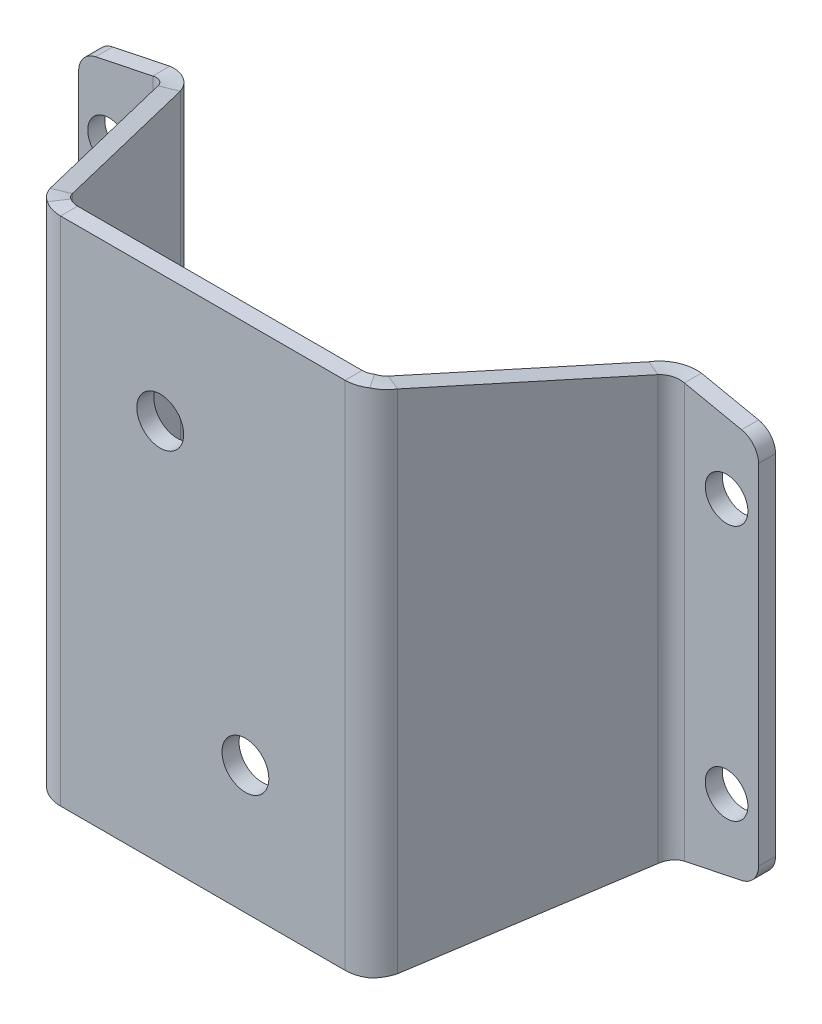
ISO-10303-21;
HEADER;
FILE_DESCRIPTION(('STEP AP214'),'2;1');
FILE_NAME('part.step','',(''),(''),'','','');
FILE_SCHEMA(('AUTOMOTIVE_DESIGN { 1 0 10303 214 1 1 1 1 }'));
ENDSEC;
DATA;
#1=APPLICATION_CONTEXT('core data for automotive mechanical design processes');
#2=APPLICATION_PROTOCOL_DEFINITION('international standard','automotive_design',2000,#1);
#3=PRODUCT_CONTEXT('',#1,'mechanical');
#4=PRODUCT('Part','Part','',(#3));
#5=PRODUCT_RELATED_PRODUCT_CATEGORY('part','',(#4));
#6=PRODUCT_DEFINITION_FORMATION('','',#4);
#7=PRODUCT_DEFINITION_CONTEXT('part definition',#1,'design');
#8=PRODUCT_DEFINITION('design','',#6,#7);
#9=PRODUCT_DEFINITION_SHAPE('','',#8);
#10=(LENGTH_UNIT() NAMED_UNIT(*) SI_UNIT(.MILLI.,.METRE.));
#11=(NAMED_UNIT(*) PLANE_ANGLE_UNIT() SI_UNIT($,.RADIAN.));
#12=(NAMED_UNIT(*) SI_UNIT($,.STERADIAN.) SOLID_ANGLE_UNIT());
#13=UNCERTAINTY_MEASURE_WITH_UNIT(LENGTH_MEASURE(1.E-05),#10,'distance_accuracy_value','');
#14=(GEOMETRIC_REPRESENTATION_CONTEXT(3) GLOBAL_UNCERTAINTY_ASSIGNED_CONTEXT((#13)) GLOBAL_UNIT_ASSIGNED_CONTEXT((#10,
#11,#12)) REPRESENTATION_CONTEXT('',''));
#15=CARTESIAN_POINT('',(0.,0.,0.));
#16=DIRECTION('',(0.,0.,1.));
#17=DIRECTION('',(1.,0.,0.));
#18=AXIS2_PLACEMENT_3D('',#15,#16,#17);
#19=CARTESIAN_POINT('',(74.8187764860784,40.9343122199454,-46.6604868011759));
#20=DIRECTION('',(0.,0.,1.));
#21=DIRECTION('',(1.,0.,0.));
#22=AXIS2_PLACEMENT_3D('',#19,#20,#21);
#23=PLANE('',#22);
#24=CARTESIAN_POINT('',(72.3187764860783,-30.,-46.6604868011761));
#25=DIRECTION('',(0.,0.,1.));
#26=DIRECTION('',(0.,-1.,0.));
#27=AXIS2_PLACEMENT_3D('',#24,#25,#26);
#28=CIRCLE('',#27,5.);
#29=CARTESIAN_POINT('',(72.3187764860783,-35.,-46.6604868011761));
#30=VERTEX_POINT('',#29);
#31=EDGE_CURVE('E911',#30,#30,#28,.T.);
#32=ORIENTED_EDGE('',*,*,#31,.F.);
#33=EDGE_LOOP('',(#32));
#34=FACE_BOUND('',#33,.T.);
#35=CARTESIAN_POINT('',(72.3187764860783,30.,-46.6604868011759));
#36=DIRECTION('',(0.,0.,1.));
#37=DIRECTION('',(0.,-1.,0.));
#38=AXIS2_PLACEMENT_3D('',#35,#36,#37);
#39=CIRCLE('',#38,5.00000000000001);
#40=CARTESIAN_POINT('',(72.3187764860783,25.,-46.6604868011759));
#41=VERTEX_POINT('',#40);
#42=EDGE_CURVE('E248',#41,#41,#39,.T.);
#43=ORIENTED_EDGE('',*,*,#42,.F.);
#44=EDGE_LOOP('',(#43));
#45=FACE_BOUND('',#44,.T.);
#46=DIRECTION('',(-0.978980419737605,0.203954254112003,0.));
#47=VECTOR('',#46,1.);
#48=CARTESIAN_POINT('',(7.81877648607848,60.0000000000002,-46.6604868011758));
#49=LINE('',#48,#47);
#50=CARTESIAN_POINT('',(75.8385477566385,45.8292143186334,-46.6604868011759));
#51=VERTEX_POINT('',#50);
#52=CARTESIAN_POINT('',(62.41059042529,48.626705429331,-46.6604868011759));
#53=VERTEX_POINT('',#52);
#54=EDGE_CURVE('E1119',#51,#53,#49,.T.);
#55=ORIENTED_EDGE('',*,*,#54,.T.);
#56=DIRECTION('',(0.,-1.,0.));
#57=VECTOR('',#56,1.);
#58=CARTESIAN_POINT('',(62.41059042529,40.9343122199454,-46.6604868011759));
#59=LINE('',#58,#57);
#60=CARTESIAN_POINT('',(62.4105904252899,-48.6267054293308,-46.6604868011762));
#61=VERTEX_POINT('',#60);
#62=EDGE_CURVE('E246',#53,#61,#59,.T.);
#63=ORIENTED_EDGE('',*,*,#62,.T.);
#64=DIRECTION('',(0.978980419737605,0.203954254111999,0.));
#65=VECTOR('',#64,1.);
#66=CARTESIAN_POINT('',(75.8385477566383,-45.8292143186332,-46.6604868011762));
#67=LINE('',#66,#65);
#68=CARTESIAN_POINT('',(75.8385477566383,-45.8292143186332,-46.6604868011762));
#69=VERTEX_POINT('',#68);
#70=EDGE_CURVE('E1210',#61,#69,#67,.T.);
#71=ORIENTED_EDGE('',*,*,#70,.T.);
#72=CARTESIAN_POINT('',(74.8187764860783,-40.9343122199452,-46.6604868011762));
#73=DIRECTION('',(0.,0.,1.));
#74=DIRECTION('',(-1.,0.,0.));
#75=AXIS2_PLACEMENT_3D('',#72,#73,#74);
#76=CIRCLE('',#75,5.00000000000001);
#77=CARTESIAN_POINT('',(79.8187764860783,-40.9343122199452,-46.6604868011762));
#78=VERTEX_POINT('',#77);
#79=EDGE_CURVE('E1213',#69,#78,#76,.T.);
#80=ORIENTED_EDGE('',*,*,#79,.T.);
#81=DIRECTION('',(0.,1.,0.));
#82=VECTOR('',#81,1.);
#83=CARTESIAN_POINT('',(79.8187764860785,40.9343122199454,-46.6604868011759));
#84=LINE('',#83,#82);
#85=CARTESIAN_POINT('',(79.8187764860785,40.9343122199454,-46.6604868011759));
#86=VERTEX_POINT('',#85);
#87=EDGE_CURVE('E1222',#78,#86,#84,.T.);
#88=ORIENTED_EDGE('',*,*,#87,.T.);
#89=CARTESIAN_POINT('',(74.8187764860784,40.9343122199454,-46.6604868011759));
#90=DIRECTION('',(0.,0.,1.));
#91=DIRECTION('',(1.,0.,0.));
#92=AXIS2_PLACEMENT_3D('',#89,#90,#91);
#93=CIRCLE('',#92,5.);
#94=EDGE_CURVE('E1128',#86,#51,#93,.T.);
#95=ORIENTED_EDGE('',*,*,#94,.T.);
#96=EDGE_LOOP('',(#55,#63,#71,#80,#88,#95));
#97=FACE_BOUND('',#96,.T.);
#98=ADVANCED_FACE('F30',(#34,#45,#97),#23,.T.);
#99=CARTESIAN_POINT('',(74.8187764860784,40.9343122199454,-50.6604868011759));
#100=DIRECTION('',(0.,0.,1.));
#101=DIRECTION('',(1.,0.,0.));
#102=AXIS2_PLACEMENT_3D('',#99,#100,#101);
#103=PLANE('',#102);
#104=CARTESIAN_POINT('',(72.3187764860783,-30.,-50.6604868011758));
#105=DIRECTION('',(0.,0.,-1.));
#106=DIRECTION('',(0.,1.,0.));
#107=AXIS2_PLACEMENT_3D('',#104,#105,#106);
#108=CIRCLE('',#107,5.);
#109=CARTESIAN_POINT('',(72.3187764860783,-25.,-50.6604868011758));
#110=VERTEX_POINT('',#109);
#111=EDGE_CURVE('E914',#110,#110,#108,.T.);
#112=ORIENTED_EDGE('',*,*,#111,.F.);
#113=EDGE_LOOP('',(#112));
#114=FACE_BOUND('',#113,.T.);
#115=CARTESIAN_POINT('',(72.3187764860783,30.,-50.6604868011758));
#116=DIRECTION('',(0.,0.,-1.));
#117=DIRECTION('',(0.,1.,0.));
#118=AXIS2_PLACEMENT_3D('',#115,#116,#117);
#119=CIRCLE('',#118,5.00000000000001);
#120=CARTESIAN_POINT('',(72.3187764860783,35.,-50.6604868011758));
#121=VERTEX_POINT('',#120);
#122=EDGE_CURVE('E903',#121,#121,#119,.T.);
#123=ORIENTED_EDGE('',*,*,#122,.F.);
#124=EDGE_LOOP('',(#123));
#125=FACE_BOUND('',#124,.T.);
#126=DIRECTION('',(0.,-1.,0.));
#127=VECTOR('',#126,1.);
#128=CARTESIAN_POINT('',(62.41059042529,40.9343122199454,-50.6604868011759));
#129=LINE('',#128,#127);
#130=CARTESIAN_POINT('',(62.41059042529,48.626705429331,-50.6604868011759));
#131=VERTEX_POINT('',#130);
#132=CARTESIAN_POINT('',(62.4105904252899,-48.6267054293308,-50.6604868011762));
#133=VERTEX_POINT('',#132);
#134=EDGE_CURVE('E54',#131,#133,#129,.T.);
#135=ORIENTED_EDGE('',*,*,#134,.F.);
#136=DIRECTION('',(-0.978980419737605,0.203954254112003,0.));
#137=VECTOR('',#136,1.);
#138=CARTESIAN_POINT('',(7.81877648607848,60.0000000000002,-50.6604868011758));
#139=LINE('',#138,#137);
#140=CARTESIAN_POINT('',(75.8385477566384,45.8292143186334,-50.6604868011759));
#141=VERTEX_POINT('',#140);
#142=EDGE_CURVE('E1141',#141,#131,#139,.T.);
#143=ORIENTED_EDGE('',*,*,#142,.F.);
#144=CARTESIAN_POINT('',(74.8187764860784,40.9343122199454,-50.6604868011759));
#145=DIRECTION('',(0.,0.,1.));
#146=DIRECTION('',(1.,0.,0.));
#147=AXIS2_PLACEMENT_3D('',#144,#145,#146);
#148=CIRCLE('',#147,5.);
#149=CARTESIAN_POINT('',(79.8187764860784,40.9343122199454,-50.6604868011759));
#150=VERTEX_POINT('',#149);
#151=EDGE_CURVE('E1211',#150,#141,#148,.T.);
#152=ORIENTED_EDGE('',*,*,#151,.F.);
#153=DIRECTION('',(0.,1.,0.));
#154=VECTOR('',#153,1.);
#155=CARTESIAN_POINT('',(79.8187764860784,40.9343122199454,-50.6604868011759));
#156=LINE('',#155,#154);
#157=CARTESIAN_POINT('',(79.8187764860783,-40.9343122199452,-50.6604868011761));
#158=VERTEX_POINT('',#157);
#159=EDGE_CURVE('E1215',#158,#150,#156,.T.);
#160=ORIENTED_EDGE('',*,*,#159,.F.);
#161=CARTESIAN_POINT('',(74.8187764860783,-40.9343122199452,-50.6604868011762));
#162=DIRECTION('',(0.,0.,1.));
#163=DIRECTION('',(-1.,0.,0.));
#164=AXIS2_PLACEMENT_3D('',#161,#162,#163);
#165=CIRCLE('',#164,5.00000000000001);
#166=CARTESIAN_POINT('',(75.8385477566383,-45.8292143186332,-50.6604868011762));
#167=VERTEX_POINT('',#166);
#168=EDGE_CURVE('E800',#167,#158,#165,.T.);
#169=ORIENTED_EDGE('',*,*,#168,.F.);
#170=DIRECTION('',(0.978980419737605,0.203954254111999,0.));
#171=VECTOR('',#170,1.);
#172=CARTESIAN_POINT('',(75.8385477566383,-45.8292143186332,-50.6604868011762));
#173=LINE('',#172,#171);
#174=EDGE_CURVE('E964',#133,#167,#173,.T.);
#175=ORIENTED_EDGE('',*,*,#174,.F.);
#176=EDGE_LOOP('',(#135,#143,#152,#160,#169,#175));
#177=FACE_BOUND('',#176,.T.);
#178=ADVANCED_FACE('F1100',(#114,#125,#177),#103,.F.);
#179=CARTESIAN_POINT('',(75.8385477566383,-45.8292143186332,-46.6604868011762));
#180=DIRECTION('',(-0.203954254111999,0.978980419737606,0.));
#181=DIRECTION('',(-0.978980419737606,-0.203954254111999,0.));
#182=AXIS2_PLACEMENT_3D('',#179,#180,#181);
#183=PLANE('',#182);
#184=CARTESIAN_POINT('',(62.4105904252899,-48.6267054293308,-50.6604868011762));
#185=CARTESIAN_POINT('',(62.4105904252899,-48.6267054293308,-46.6604868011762));
#186=B_SPLINE_CURVE_WITH_KNOTS('',1,(#184,#185),.UNSPECIFIED.,.F.,.F.,(2,2),(0.,1.),.UNSPECIFIED.);
#187=EDGE_CURVE('E40',#133,#61,#186,.T.);
#188=ORIENTED_EDGE('',*,*,#187,.F.);
#189=ORIENTED_EDGE('',*,*,#174,.T.);
#190=DIRECTION('',(0.,0.,-1.));
#191=VECTOR('',#190,1.);
#192=CARTESIAN_POINT('',(75.8385477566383,-45.8292143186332,-46.6604868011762));
#193=LINE('',#192,#191);
#194=EDGE_CURVE('E1199',#69,#167,#193,.T.);
#195=ORIENTED_EDGE('',*,*,#194,.F.);
#196=ORIENTED_EDGE('',*,*,#70,.F.);
#197=EDGE_LOOP('',(#188,#189,#195,#196));
#198=FACE_BOUND('',#197,.T.);
#199=ADVANCED_FACE('F32',(#198),#183,.F.);
#200=CARTESIAN_POINT('',(74.8187764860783,-40.9343122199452,-46.6604868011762));
#201=DIRECTION('',(0.,0.,-1.));
#202=DIRECTION('',(-1.,0.,0.));
#203=AXIS2_PLACEMENT_3D('',#200,#201,#202);
#204=CYLINDRICAL_SURFACE('',#203,5.00000000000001);
#205=ORIENTED_EDGE('',*,*,#168,.T.);
#206=DIRECTION('',(0.,0.,-1.));
#207=VECTOR('',#206,1.);
#208=CARTESIAN_POINT('',(79.8187764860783,-40.9343122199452,-46.6604868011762));
#209=LINE('',#208,#207);
#210=EDGE_CURVE('E1228',#78,#158,#209,.T.);
#211=ORIENTED_EDGE('',*,*,#210,.F.);
#212=ORIENTED_EDGE('',*,*,#79,.F.);
#213=ORIENTED_EDGE('',*,*,#194,.T.);
#214=EDGE_LOOP('',(#205,#211,#212,#213));
#215=FACE_BOUND('',#214,.T.);
#216=ADVANCED_FACE('F1240',(#215),#204,.T.);
#217=CARTESIAN_POINT('',(79.8187764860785,40.9343122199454,-46.6604868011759));
#218=DIRECTION('',(-1.,0.,0.));
#219=DIRECTION('',(0.,-1.,0.));
#220=AXIS2_PLACEMENT_3D('',#217,#218,#219);
#221=PLANE('',#220);
#222=ORIENTED_EDGE('',*,*,#159,.T.);
#223=DIRECTION('',(0.,0.,-1.));
#224=VECTOR('',#223,1.);
#225=CARTESIAN_POINT('',(79.8187764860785,40.9343122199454,-46.6604868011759));
#226=LINE('',#225,#224);
#227=EDGE_CURVE('E1226',#86,#150,#226,.T.);
#228=ORIENTED_EDGE('',*,*,#227,.F.);
#229=ORIENTED_EDGE('',*,*,#87,.F.);
#230=ORIENTED_EDGE('',*,*,#210,.T.);
#231=EDGE_LOOP('',(#222,#228,#229,#230));
#232=FACE_BOUND('',#231,.T.);
#233=ADVANCED_FACE('F1245',(#232),#221,.F.);
#234=CARTESIAN_POINT('',(74.8187764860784,40.9343122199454,-46.6604868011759));
#235=DIRECTION('',(0.,0.,-1.));
#236=DIRECTION('',(-1.,0.,0.));
#237=AXIS2_PLACEMENT_3D('',#234,#235,#236);
#238=CYLINDRICAL_SURFACE('',#237,5.);
#239=ORIENTED_EDGE('',*,*,#151,.T.);
#240=DIRECTION('',(0.,0.,-1.));
#241=VECTOR('',#240,1.);
#242=CARTESIAN_POINT('',(75.8385477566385,45.8292143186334,-46.6604868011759));
#243=LINE('',#242,#241);
#244=EDGE_CURVE('E1127',#51,#141,#243,.T.);
#245=ORIENTED_EDGE('',*,*,#244,.F.);
#246=ORIENTED_EDGE('',*,*,#94,.F.);
#247=ORIENTED_EDGE('',*,*,#227,.T.);
#248=EDGE_LOOP('',(#239,#245,#246,#247));
#249=FACE_BOUND('',#248,.T.);
#250=ADVANCED_FACE('F1110',(#249),#238,.T.);
#251=CARTESIAN_POINT('',(7.81877648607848,60.0000000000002,-46.6604868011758));
#252=DIRECTION('',(-0.203954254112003,-0.978980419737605,0.));
#253=DIRECTION('',(0.978980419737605,-0.203954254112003,0.));
#254=AXIS2_PLACEMENT_3D('',#251,#252,#253);
#255=PLANE('',#254);
#256=CARTESIAN_POINT('',(62.41059042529,48.626705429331,-46.6604868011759));
#257=CARTESIAN_POINT('',(62.41059042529,48.626705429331,-50.6604868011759));
#258=B_SPLINE_CURVE_WITH_KNOTS('',1,(#256,#257),.UNSPECIFIED.,.F.,.F.,(2,2),(0.,1.),.UNSPECIFIED.);
#259=EDGE_CURVE('E11',#53,#131,#258,.T.);
#260=ORIENTED_EDGE('',*,*,#259,.F.);
#261=ORIENTED_EDGE('',*,*,#54,.F.);
#262=ORIENTED_EDGE('',*,*,#244,.T.);
#263=ORIENTED_EDGE('',*,*,#142,.T.);
#264=EDGE_LOOP('',(#260,#261,#262,#263));
#265=FACE_BOUND('',#264,.T.);
#266=ADVANCED_FACE('F822',(#265),#255,.F.);
#267=CARTESIAN_POINT('',(131.181223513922,40.9343122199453,-46.6604868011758));
#268=DIRECTION('',(0.,0.,1.));
#269=DIRECTION('',(1.,0.,0.));
#270=AXIS2_PLACEMENT_3D('',#267,#268,#269);
#271=PLANE('',#270);
#272=CARTESIAN_POINT('',(-72.6812235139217,30.,-46.6604868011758));
#273=DIRECTION('',(0.,0.,1.));
#274=DIRECTION('',(0.,-1.,0.));
#275=AXIS2_PLACEMENT_3D('',#272,#273,#274);
#276=CIRCLE('',#275,5.00000000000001);
#277=CARTESIAN_POINT('',(-72.6812235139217,25.,-46.6604868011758));
#278=VERTEX_POINT('',#277);
#279=EDGE_CURVE('E920',#278,#278,#276,.T.);
#280=ORIENTED_EDGE('',*,*,#279,.F.);
#281=EDGE_LOOP('',(#280));
#282=FACE_BOUND('',#281,.T.);
#283=CARTESIAN_POINT('',(-72.6812235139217,-30.,-46.6604868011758));
#284=DIRECTION('',(0.,0.,1.));
#285=DIRECTION('',(0.,-1.,0.));
#286=AXIS2_PLACEMENT_3D('',#283,#284,#285);
#287=CIRCLE('',#286,5.);
#288=CARTESIAN_POINT('',(-72.6812235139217,-35.,-46.6604868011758));
#289=VERTEX_POINT('',#288);
#290=EDGE_CURVE('E35',#289,#289,#287,.T.);
#291=ORIENTED_EDGE('',*,*,#290,.F.);
#292=EDGE_LOOP('',(#291));
#293=FACE_BOUND('',#292,.T.);
#294=DIRECTION('',(0.978980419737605,-0.203954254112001,0.));
#295=VECTOR('',#294,1.);
#296=CARTESIAN_POINT('',(-7.81877648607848,-60.,-46.6604868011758));
#297=LINE('',#296,#295);
#298=CARTESIAN_POINT('',(-75.8385477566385,-45.8292143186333,-46.6604868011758));
#299=VERTEX_POINT('',#298);
#300=CARTESIAN_POINT('',(-62.4105904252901,-48.6267054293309,-46.6604868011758));
#301=VERTEX_POINT('',#300);
#302=EDGE_CURVE('E837',#299,#301,#297,.T.);
#303=ORIENTED_EDGE('',*,*,#302,.T.);
#304=DIRECTION('',(0.,1.,0.));
#305=VECTOR('',#304,1.);
#306=CARTESIAN_POINT('',(-62.4105904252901,40.9343122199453,-46.6604868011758));
#307=LINE('',#306,#305);
#308=CARTESIAN_POINT('',(-62.41059042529,48.6267054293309,-46.6604868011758));
#309=VERTEX_POINT('',#308);
#310=EDGE_CURVE('E944',#301,#309,#307,.T.);
#311=ORIENTED_EDGE('',*,*,#310,.T.);
#312=DIRECTION('',(-0.978980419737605,-0.203954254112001,0.));
#313=VECTOR('',#312,1.);
#314=CARTESIAN_POINT('',(-75.8385477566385,45.8292143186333,-46.6604868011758));
#315=LINE('',#314,#313);
#316=CARTESIAN_POINT('',(-75.8385477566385,45.8292143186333,-46.6604868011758));
#317=VERTEX_POINT('',#316);
#318=EDGE_CURVE('E951',#309,#317,#315,.T.);
#319=ORIENTED_EDGE('',*,*,#318,.T.);
#320=CARTESIAN_POINT('',(-74.8187764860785,40.9343122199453,-46.6604868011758));
#321=DIRECTION('',(0.,0.,1.));
#322=DIRECTION('',(-1.,0.,0.));
#323=AXIS2_PLACEMENT_3D('',#320,#321,#322);
#324=CIRCLE('',#323,5.);
#325=CARTESIAN_POINT('',(-79.8187764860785,40.9343122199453,-46.6604868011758));
#326=VERTEX_POINT('',#325);
#327=EDGE_CURVE('E1652',#317,#326,#324,.T.);
#328=ORIENTED_EDGE('',*,*,#327,.T.);
#329=DIRECTION('',(0.,-1.,0.));
#330=VECTOR('',#329,1.);
#331=CARTESIAN_POINT('',(-79.8187764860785,-40.9343122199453,-46.6604868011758));
#332=LINE('',#331,#330);
#333=CARTESIAN_POINT('',(-79.8187764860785,-40.9343122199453,-46.6604868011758));
#334=VERTEX_POINT('',#333);
#335=EDGE_CURVE('E1637',#326,#334,#332,.T.);
#336=ORIENTED_EDGE('',*,*,#335,.T.);
#337=CARTESIAN_POINT('',(-74.8187764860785,-40.9343122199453,-46.6604868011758));
#338=DIRECTION('',(0.,0.,1.));
#339=DIRECTION('',(-1.,0.,0.));
#340=AXIS2_PLACEMENT_3D('',#337,#338,#339);
#341=CIRCLE('',#340,5.);
#342=EDGE_CURVE('E846',#334,#299,#341,.T.);
#343=ORIENTED_EDGE('',*,*,#342,.T.);
#344=EDGE_LOOP('',(#303,#311,#319,#328,#336,#343));
#345=FACE_BOUND('',#344,.T.);
#346=ADVANCED_FACE('F818',(#282,#293,#345),#271,.T.);
#347=CARTESIAN_POINT('',(131.181223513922,40.9343122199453,-50.6604868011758));
#348=DIRECTION('',(0.,0.,1.));
#349=DIRECTION('',(1.,0.,0.));
#350=AXIS2_PLACEMENT_3D('',#347,#348,#349);
#351=PLANE('',#350);
#352=CARTESIAN_POINT('',(-72.6812235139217,30.,-50.6604868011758));
#353=DIRECTION('',(0.,0.,-1.));
#354=DIRECTION('',(0.,1.,0.));
#355=AXIS2_PLACEMENT_3D('',#352,#353,#354);
#356=CIRCLE('',#355,5.00000000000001);
#357=CARTESIAN_POINT('',(-72.6812235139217,35.,-50.6604868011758));
#358=VERTEX_POINT('',#357);
#359=EDGE_CURVE('E923',#358,#358,#356,.T.);
#360=ORIENTED_EDGE('',*,*,#359,.F.);
#361=EDGE_LOOP('',(#360));
#362=FACE_BOUND('',#361,.T.);
#363=CARTESIAN_POINT('',(-72.6812235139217,-30.,-50.6604868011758));
#364=DIRECTION('',(0.,0.,-1.));
#365=DIRECTION('',(0.,1.,0.));
#366=AXIS2_PLACEMENT_3D('',#363,#364,#365);
#367=CIRCLE('',#366,5.);
#368=CARTESIAN_POINT('',(-72.6812235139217,-25.,-50.6604868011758));
#369=VERTEX_POINT('',#368);
#370=EDGE_CURVE('E917',#369,#369,#367,.T.);
#371=ORIENTED_EDGE('',*,*,#370,.F.);
#372=EDGE_LOOP('',(#371));
#373=FACE_BOUND('',#372,.T.);
#374=DIRECTION('',(0.,1.,0.));
#375=VECTOR('',#374,1.);
#376=CARTESIAN_POINT('',(-62.4105904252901,40.9343122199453,-50.6604868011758));
#377=LINE('',#376,#375);
#378=CARTESIAN_POINT('',(-62.4105904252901,-48.6267054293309,-50.6604868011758));
#379=VERTEX_POINT('',#378);
#380=CARTESIAN_POINT('',(-62.4105904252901,48.6267054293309,-50.6604868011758));
#381=VERTEX_POINT('',#380);
#382=EDGE_CURVE('E934',#379,#381,#377,.T.);
#383=ORIENTED_EDGE('',*,*,#382,.F.);
#384=DIRECTION('',(0.978980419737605,-0.203954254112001,0.));
#385=VECTOR('',#384,1.);
#386=CARTESIAN_POINT('',(-7.81877648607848,-60.,-50.6604868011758));
#387=LINE('',#386,#385);
#388=CARTESIAN_POINT('',(-75.8385477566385,-45.8292143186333,-50.6604868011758));
#389=VERTEX_POINT('',#388);
#390=EDGE_CURVE('E937',#389,#379,#387,.T.);
#391=ORIENTED_EDGE('',*,*,#390,.F.);
#392=CARTESIAN_POINT('',(-74.8187764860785,-40.9343122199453,-50.6604868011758));
#393=DIRECTION('',(0.,0.,1.));
#394=DIRECTION('',(-1.,0.,0.));
#395=AXIS2_PLACEMENT_3D('',#392,#393,#394);
#396=CIRCLE('',#395,5.);
#397=CARTESIAN_POINT('',(-79.8187764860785,-40.9343122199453,-50.6604868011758));
#398=VERTEX_POINT('',#397);
#399=EDGE_CURVE('E952',#398,#389,#396,.T.);
#400=ORIENTED_EDGE('',*,*,#399,.F.);
#401=DIRECTION('',(0.,-1.,0.));
#402=VECTOR('',#401,1.);
#403=CARTESIAN_POINT('',(-79.8187764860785,-40.9343122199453,-50.6604868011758));
#404=LINE('',#403,#402);
#405=CARTESIAN_POINT('',(-79.8187764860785,40.9343122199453,-50.6604868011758));
#406=VERTEX_POINT('',#405);
#407=EDGE_CURVE('E1659',#406,#398,#404,.T.);
#408=ORIENTED_EDGE('',*,*,#407,.F.);
#409=CARTESIAN_POINT('',(-74.8187764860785,40.9343122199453,-50.6604868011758));
#410=DIRECTION('',(0.,0.,1.));
#411=DIRECTION('',(-1.,0.,0.));
#412=AXIS2_PLACEMENT_3D('',#409,#410,#411);
#413=CIRCLE('',#412,5.);
#414=CARTESIAN_POINT('',(-75.8385477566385,45.8292143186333,-50.6604868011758));
#415=VERTEX_POINT('',#414);
#416=EDGE_CURVE('E1661',#415,#406,#413,.T.);
#417=ORIENTED_EDGE('',*,*,#416,.F.);
#418=DIRECTION('',(-0.978980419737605,-0.203954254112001,0.));
#419=VECTOR('',#418,1.);
#420=CARTESIAN_POINT('',(-75.8385477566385,45.8292143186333,-50.6604868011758));
#421=LINE('',#420,#419);
#422=EDGE_CURVE('E258',#381,#415,#421,.T.);
#423=ORIENTED_EDGE('',*,*,#422,.F.);
#424=EDGE_LOOP('',(#383,#391,#400,#408,#417,#423));
#425=FACE_BOUND('',#424,.T.);
#426=ADVANCED_FACE('F813',(#362,#373,#425),#351,.F.);
#427=CARTESIAN_POINT('',(-75.8385477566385,45.8292143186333,-46.6604868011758));
#428=DIRECTION('',(0.203954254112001,-0.978980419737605,0.));
#429=DIRECTION('',(0.978980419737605,0.203954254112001,0.));
#430=AXIS2_PLACEMENT_3D('',#427,#428,#429);
#431=PLANE('',#430);
#432=CARTESIAN_POINT('',(-62.41059042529,48.6267054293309,-50.6604868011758));
#433=CARTESIAN_POINT('',(-62.41059042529,48.6267054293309,-46.6604868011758));
#434=B_SPLINE_CURVE_WITH_KNOTS('',1,(#432,#433),.UNSPECIFIED.,.F.,.F.,(2,2),(0.,1.),.UNSPECIFIED.);
#435=EDGE_CURVE('E943',#381,#309,#434,.T.);
#436=ORIENTED_EDGE('',*,*,#435,.F.);
#437=ORIENTED_EDGE('',*,*,#422,.T.);
#438=DIRECTION('',(0.,0.,-1.));
#439=VECTOR('',#438,1.);
#440=CARTESIAN_POINT('',(-75.8385477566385,45.8292143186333,-46.6604868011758));
#441=LINE('',#440,#439);
#442=EDGE_CURVE('E1649',#317,#415,#441,.T.);
#443=ORIENTED_EDGE('',*,*,#442,.F.);
#444=ORIENTED_EDGE('',*,*,#318,.F.);
#445=EDGE_LOOP('',(#436,#437,#443,#444));
#446=FACE_BOUND('',#445,.T.);
#447=ADVANCED_FACE('F817',(#446),#431,.F.);
#448=CARTESIAN_POINT('',(-74.8187764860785,40.9343122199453,-46.6604868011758));
#449=DIRECTION('',(0.,0.,-1.));
#450=DIRECTION('',(-1.,0.,0.));
#451=AXIS2_PLACEMENT_3D('',#448,#449,#450);
#452=CYLINDRICAL_SURFACE('',#451,5.);
#453=ORIENTED_EDGE('',*,*,#416,.T.);
#454=DIRECTION('',(0.,0.,-1.));
#455=VECTOR('',#454,1.);
#456=CARTESIAN_POINT('',(-79.8187764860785,40.9343122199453,-46.6604868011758));
#457=LINE('',#456,#455);
#458=EDGE_CURVE('E1643',#326,#406,#457,.T.);
#459=ORIENTED_EDGE('',*,*,#458,.F.);
#460=ORIENTED_EDGE('',*,*,#327,.F.);
#461=ORIENTED_EDGE('',*,*,#442,.T.);
#462=EDGE_LOOP('',(#453,#459,#460,#461));
#463=FACE_BOUND('',#462,.T.);
#464=ADVANCED_FACE('F1099',(#463),#452,.T.);
#465=CARTESIAN_POINT('',(-79.8187764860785,-40.9343122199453,-46.6604868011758));
#466=DIRECTION('',(1.,0.,0.));
#467=DIRECTION('',(0.,0.,-1.));
#468=AXIS2_PLACEMENT_3D('',#465,#466,#467);
#469=PLANE('',#468);
#470=ORIENTED_EDGE('',*,*,#407,.T.);
#471=DIRECTION('',(0.,0.,-1.));
#472=VECTOR('',#471,1.);
#473=CARTESIAN_POINT('',(-79.8187764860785,-40.9343122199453,-46.6604868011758));
#474=LINE('',#473,#472);
#475=EDGE_CURVE('E1641',#334,#398,#474,.T.);
#476=ORIENTED_EDGE('',*,*,#475,.F.);
#477=ORIENTED_EDGE('',*,*,#335,.F.);
#478=ORIENTED_EDGE('',*,*,#458,.T.);
#479=EDGE_LOOP('',(#470,#476,#477,#478));
#480=FACE_BOUND('',#479,.T.);
#481=ADVANCED_FACE('F1540',(#480),#469,.F.);
#482=CARTESIAN_POINT('',(-74.8187764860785,-40.9343122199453,-46.6604868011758));
#483=DIRECTION('',(0.,0.,-1.));
#484=DIRECTION('',(-1.,0.,0.));
#485=AXIS2_PLACEMENT_3D('',#482,#483,#484);
#486=CYLINDRICAL_SURFACE('',#485,5.);
#487=ORIENTED_EDGE('',*,*,#399,.T.);
#488=DIRECTION('',(0.,0.,-1.));
#489=VECTOR('',#488,1.);
#490=CARTESIAN_POINT('',(-75.8385477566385,-45.8292143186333,-46.6604868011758));
#491=LINE('',#490,#489);
#492=EDGE_CURVE('E845',#299,#389,#491,.T.);
#493=ORIENTED_EDGE('',*,*,#492,.F.);
#494=ORIENTED_EDGE('',*,*,#342,.F.);
#495=ORIENTED_EDGE('',*,*,#475,.T.);
#496=EDGE_LOOP('',(#487,#493,#494,#495));
#497=FACE_BOUND('',#496,.T.);
#498=ADVANCED_FACE('F828',(#497),#486,.T.);
#499=CARTESIAN_POINT('',(-7.81877648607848,-60.,-46.6604868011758));
#500=DIRECTION('',(0.203954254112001,0.978980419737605,0.));
#501=DIRECTION('',(-0.978980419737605,0.203954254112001,0.));
#502=AXIS2_PLACEMENT_3D('',#499,#500,#501);
#503=PLANE('',#502);
#504=CARTESIAN_POINT('',(-62.41059042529,-48.626705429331,-46.6604868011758));
#505=CARTESIAN_POINT('',(-62.41059042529,-48.626705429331,-50.6604868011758));
#506=B_SPLINE_CURVE_WITH_KNOTS('',1,(#504,#505),.UNSPECIFIED.,.F.,.F.,(2,2),(0.,1.),.UNSPECIFIED.);
#507=EDGE_CURVE('E949',#301,#379,#506,.T.);
#508=ORIENTED_EDGE('',*,*,#507,.F.);
#509=ORIENTED_EDGE('',*,*,#302,.F.);
#510=ORIENTED_EDGE('',*,*,#492,.T.);
#511=ORIENTED_EDGE('',*,*,#390,.T.);
#512=EDGE_LOOP('',(#508,#509,#510,#511));
#513=FACE_BOUND('',#512,.T.);
#514=ADVANCED_FACE('F824',(#513),#503,.F.);
#515=CARTESIAN_POINT('',(61.7516499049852,40.9343122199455,-61.974671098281));
#516=DIRECTION('',(0.923879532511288,0.,0.382683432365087));
#517=DIRECTION('',(0.382683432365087,0.,-0.923879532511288));
#518=AXIS2_PLACEMENT_3D('',#515,#516,#517);
#519=PLANE('',#518);
#520=DIRECTION('',(-0.3746395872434,0.203954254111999,0.904459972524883));
#521=VECTOR('',#520,1.);
#522=CARTESIAN_POINT('',(36.1118599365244,60.,-0.074742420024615));
#523=LINE('',#522,#521);
#524=CARTESIAN_POINT('',(55.0195541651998,49.7066279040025,-45.7219542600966));
#525=VERTEX_POINT('',#524);
#526=CARTESIAN_POINT('',(37.1037041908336,59.4600387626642,-2.46926627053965));
#527=VERTEX_POINT('',#526);
#528=EDGE_CURVE('E270',#525,#527,#523,.T.);
#529=ORIENTED_EDGE('',*,*,#528,.F.);
#530=DIRECTION('',(0.,-1.,0.));
#531=VECTOR('',#530,1.);
#532=CARTESIAN_POINT('',(55.0195541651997,40.9343122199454,-45.7219542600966));
#533=LINE('',#532,#531);
#534=CARTESIAN_POINT('',(55.0195541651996,-49.7066279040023,-45.7219542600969));
#535=VERTEX_POINT('',#534);
#536=EDGE_CURVE('E259',#525,#535,#533,.T.);
#537=ORIENTED_EDGE('',*,*,#536,.T.);
#538=DIRECTION('',(0.374639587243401,0.203954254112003,-0.904459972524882));
#539=VECTOR('',#538,1.);
#540=CARTESIAN_POINT('',(62.1418994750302,-45.8292143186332,-62.9168169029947));
#541=LINE('',#540,#539);
#542=CARTESIAN_POINT('',(37.1037041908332,-59.4600387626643,-2.46926627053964));
#543=VERTEX_POINT('',#542);
#544=EDGE_CURVE('E286',#543,#535,#541,.T.);
#545=ORIENTED_EDGE('',*,*,#544,.F.);
#546=DIRECTION('',(0.,-1.,0.));
#547=VECTOR('',#546,1.);
#548=CARTESIAN_POINT('',(37.1037041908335,40.9343122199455,-2.46926627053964));
#549=LINE('',#548,#547);
#550=EDGE_CURVE('E265',#527,#543,#549,.T.);
#551=ORIENTED_EDGE('',*,*,#550,.F.);
#552=EDGE_LOOP('',(#529,#537,#545,#551));
#553=FACE_BOUND('',#552,.T.);
#554=ADVANCED_FACE('F810',(#553),#519,.F.);
#555=CARTESIAN_POINT('',(65.8374176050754,-45.8292143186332,-61.3860831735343));
#556=DIRECTION('',(-0.0780499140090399,0.978980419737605,0.188429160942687));
#557=DIRECTION('',(-0.374639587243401,-0.203954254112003,0.904459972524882));
#558=AXIS2_PLACEMENT_3D('',#555,#556,#557);
#559=PLANE('',#558);
#560=ORIENTED_EDGE('',*,*,#544,.T.);
#561=CARTESIAN_POINT('',(58.7150722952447,-49.7066279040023,-44.1912205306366));
#562=CARTESIAN_POINT('',(55.0195541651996,-49.7066279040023,-45.7219542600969));
#563=B_SPLINE_CURVE_WITH_KNOTS('',1,(#561,#562),.UNSPECIFIED.,.F.,.F.,(2,2),(0.,1.),.UNSPECIFIED.);
#564=CARTESIAN_POINT('',(58.7150722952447,-49.7066279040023,-44.1912205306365));
#565=VERTEX_POINT('',#564);
#566=EDGE_CURVE('E234',#535,#565,#563,.F.);
#567=ORIENTED_EDGE('',*,*,#566,.T.);
#568=DIRECTION('',(0.374639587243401,0.203954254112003,-0.904459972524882));
#569=VECTOR('',#568,1.);
#570=CARTESIAN_POINT('',(65.8374176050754,-45.8292143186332,-61.3860831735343));
#571=LINE('',#570,#569);
#572=CARTESIAN_POINT('',(40.7992223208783,-59.4600387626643,-0.938532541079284));
#573=VERTEX_POINT('',#572);
#574=EDGE_CURVE('E257',#573,#565,#571,.T.);
#575=ORIENTED_EDGE('',*,*,#574,.F.);
#576=CARTESIAN_POINT('',(37.1037041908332,-59.4600387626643,-2.46926627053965));
#577=CARTESIAN_POINT('',(40.7992223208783,-59.4600387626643,-0.938532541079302));
#578=B_SPLINE_CURVE_WITH_KNOTS('',1,(#576,#577),.UNSPECIFIED.,.F.,.F.,(2,2),(0.,1.),.UNSPECIFIED.);
#579=EDGE_CURVE('E751',#543,#573,#578,.T.);
#580=ORIENTED_EDGE('',*,*,#579,.F.);
#581=EDGE_LOOP('',(#560,#567,#575,#580));
#582=FACE_BOUND('',#581,.T.);
#583=ADVANCED_FACE('F787',(#582),#559,.F.);
#584=CARTESIAN_POINT('',(39.8073780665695,60.,1.45599130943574));
#585=DIRECTION('',(-0.0780499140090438,-0.978980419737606,0.188429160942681));
#586=DIRECTION('',(0.3746395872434,-0.203954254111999,-0.904459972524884));
#587=AXIS2_PLACEMENT_3D('',#584,#585,#586);
#588=PLANE('',#587);
#589=DIRECTION('',(-0.3746395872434,0.203954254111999,0.904459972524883));
#590=VECTOR('',#589,1.);
#591=CARTESIAN_POINT('',(39.8073780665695,60.,1.45599130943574));
#592=LINE('',#591,#590);
#593=CARTESIAN_POINT('',(58.7150722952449,49.7066279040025,-44.1912205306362));
#594=VERTEX_POINT('',#593);
#595=CARTESIAN_POINT('',(40.7992223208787,59.4600387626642,-0.938532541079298));
#596=VERTEX_POINT('',#595);
#597=EDGE_CURVE('E254',#594,#596,#592,.T.);
#598=ORIENTED_EDGE('',*,*,#597,.F.);
#599=CARTESIAN_POINT('',(55.0195541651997,49.7066279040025,-45.7219542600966));
#600=CARTESIAN_POINT('',(58.7150722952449,49.7066279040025,-44.1912205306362));
#601=B_SPLINE_CURVE_WITH_KNOTS('',1,(#599,#600),.UNSPECIFIED.,.F.,.F.,(2,2),(0.,1.),.UNSPECIFIED.);
#602=EDGE_CURVE('E218',#594,#525,#601,.F.);
#603=ORIENTED_EDGE('',*,*,#602,.T.);
#604=ORIENTED_EDGE('',*,*,#528,.T.);
#605=CARTESIAN_POINT('',(40.7992223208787,59.4600387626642,-0.938532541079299));
#606=CARTESIAN_POINT('',(37.1037041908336,59.4600387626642,-2.46926627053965));
#607=B_SPLINE_CURVE_WITH_KNOTS('',1,(#605,#606),.UNSPECIFIED.,.F.,.F.,(2,2),(0.,1.),.UNSPECIFIED.);
#608=EDGE_CURVE('E235',#596,#527,#607,.T.);
#609=ORIENTED_EDGE('',*,*,#608,.F.);
#610=EDGE_LOOP('',(#598,#603,#604,#609));
#611=FACE_BOUND('',#610,.T.);
#612=ADVANCED_FACE('F261',(#611),#588,.F.);
#613=CARTESIAN_POINT('',(65.4471680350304,40.9343122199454,-60.4439373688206));
#614=DIRECTION('',(0.923879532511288,0.,0.382683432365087));
#615=DIRECTION('',(0.382683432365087,0.,-0.923879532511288));
#616=AXIS2_PLACEMENT_3D('',#613,#614,#615);
#617=PLANE('',#616);
#618=DIRECTION('',(0.,-1.,0.));
#619=VECTOR('',#618,1.);
#620=CARTESIAN_POINT('',(58.7150722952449,40.9343122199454,-44.1912205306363));
#621=LINE('',#620,#619);
#622=EDGE_CURVE('E243',#594,#565,#621,.T.);
#623=ORIENTED_EDGE('',*,*,#622,.F.);
#624=ORIENTED_EDGE('',*,*,#597,.T.);
#625=DIRECTION('',(0.,-1.,0.));
#626=VECTOR('',#625,1.);
#627=CARTESIAN_POINT('',(40.7992223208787,40.9343122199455,-0.938532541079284));
#628=LINE('',#627,#626);
#629=EDGE_CURVE('E268',#596,#573,#628,.T.);
#630=ORIENTED_EDGE('',*,*,#629,.T.);
#631=ORIENTED_EDGE('',*,*,#574,.T.);
#632=EDGE_LOOP('',(#623,#624,#630,#631));
#633=FACE_BOUND('',#632,.T.);
#634=ADVANCED_FACE('F253',(#633),#617,.T.);
#635=CARTESIAN_POINT('',(17.0811371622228,40.9343122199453,128.344512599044));
#636=DIRECTION('',(-0.923879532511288,0.,0.382683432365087));
#637=DIRECTION('',(0.382683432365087,0.,0.923879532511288));
#638=AXIS2_PLACEMENT_3D('',#635,#636,#637);
#639=PLANE('',#638);
#640=DIRECTION('',(0.374639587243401,-0.203954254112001,0.904459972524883));
#641=VECTOR('',#640,1.);
#642=CARTESIAN_POINT('',(-36.1118599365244,-60.,-0.074742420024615));
#643=LINE('',#642,#641);
#644=CARTESIAN_POINT('',(-55.0195541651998,-49.7066279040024,-45.7219542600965));
#645=VERTEX_POINT('',#644);
#646=CARTESIAN_POINT('',(-37.1037041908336,-59.4600387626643,-2.46926627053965));
#647=VERTEX_POINT('',#646);
#648=EDGE_CURVE('E365',#645,#647,#643,.T.);
#649=ORIENTED_EDGE('',*,*,#648,.F.);
#650=DIRECTION('',(0.,1.,0.));
#651=VECTOR('',#650,1.);
#652=CARTESIAN_POINT('',(-55.0195541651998,40.9343122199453,-45.7219542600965));
#653=LINE('',#652,#651);
#654=CARTESIAN_POINT('',(-55.0195541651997,49.7066279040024,-45.7219542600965));
#655=VERTEX_POINT('',#654);
#656=EDGE_CURVE('E303',#645,#655,#653,.T.);
#657=ORIENTED_EDGE('',*,*,#656,.T.);
#658=DIRECTION('',(-0.374639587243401,-0.203954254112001,-0.904459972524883));
#659=VECTOR('',#658,1.);
#660=CARTESIAN_POINT('',(-62.1418994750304,45.8292143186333,-62.9168169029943));
#661=LINE('',#660,#659);
#662=CARTESIAN_POINT('',(-37.1037041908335,59.4600387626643,-2.46926627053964));
#663=VERTEX_POINT('',#662);
#664=EDGE_CURVE('E291',#663,#655,#661,.T.);
#665=ORIENTED_EDGE('',*,*,#664,.F.);
#666=DIRECTION('',(0.,1.,0.));
#667=VECTOR('',#666,1.);
#668=CARTESIAN_POINT('',(-37.1037041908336,40.9343122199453,-2.46926627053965));
#669=LINE('',#668,#667);
#670=EDGE_CURVE('E360',#647,#663,#669,.T.);
#671=ORIENTED_EDGE('',*,*,#670,.F.);
#672=EDGE_LOOP('',(#649,#657,#665,#671));
#673=FACE_BOUND('',#672,.T.);
#674=ADVANCED_FACE('F1490',(#673),#639,.F.);
#675=CARTESIAN_POINT('',(-65.8374176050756,45.8292143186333,-61.386083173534));
#676=DIRECTION('',(0.0780499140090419,-0.978980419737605,0.188429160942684));
#677=DIRECTION('',(0.374639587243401,0.203954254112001,0.904459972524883));
#678=AXIS2_PLACEMENT_3D('',#675,#676,#677);
#679=PLANE('',#678);
#680=ORIENTED_EDGE('',*,*,#664,.T.);
#681=CARTESIAN_POINT('',(-58.7150722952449,49.7066279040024,-44.1912205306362));
#682=CARTESIAN_POINT('',(-55.0195541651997,49.7066279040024,-45.7219542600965));
#683=B_SPLINE_CURVE_WITH_KNOTS('',1,(#681,#682),.UNSPECIFIED.,.F.,.F.,(2,2),(0.,1.),.UNSPECIFIED.);
#684=CARTESIAN_POINT('',(-58.7150722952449,49.7066279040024,-44.1912205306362));
#685=VERTEX_POINT('',#684);
#686=EDGE_CURVE('E306',#655,#685,#683,.F.);
#687=ORIENTED_EDGE('',*,*,#686,.T.);
#688=DIRECTION('',(-0.374639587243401,-0.203954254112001,-0.904459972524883));
#689=VECTOR('',#688,1.);
#690=CARTESIAN_POINT('',(-65.8374176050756,45.8292143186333,-61.386083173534));
#691=LINE('',#690,#689);
#692=CARTESIAN_POINT('',(-40.7992223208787,59.4600387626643,-0.938532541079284));
#693=VERTEX_POINT('',#692);
#694=EDGE_CURVE('E353',#693,#685,#691,.T.);
#695=ORIENTED_EDGE('',*,*,#694,.F.);
#696=CARTESIAN_POINT('',(-37.1037041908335,59.4600387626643,-2.46926627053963));
#697=CARTESIAN_POINT('',(-40.7992223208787,59.4600387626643,-0.938532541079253));
#698=B_SPLINE_CURVE_WITH_KNOTS('',1,(#696,#697),.UNSPECIFIED.,.F.,.F.,(2,2),(0.,1.),.UNSPECIFIED.);
#699=EDGE_CURVE('E363',#663,#693,#698,.T.);
#700=ORIENTED_EDGE('',*,*,#699,.F.);
#701=EDGE_LOOP('',(#680,#687,#695,#700));
#702=FACE_BOUND('',#701,.T.);
#703=ADVANCED_FACE('F332',(#702),#679,.F.);
#704=CARTESIAN_POINT('',(-39.8073780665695,-60.,1.45599130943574));
#705=DIRECTION('',(0.0780499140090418,0.978980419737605,0.188429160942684));
#706=DIRECTION('',(-0.374639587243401,0.203954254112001,-0.904459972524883));
#707=AXIS2_PLACEMENT_3D('',#704,#705,#706);
#708=PLANE('',#707);
#709=DIRECTION('',(0.374639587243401,-0.203954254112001,0.904459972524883));
#710=VECTOR('',#709,1.);
#711=CARTESIAN_POINT('',(-39.8073780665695,-60.,1.45599130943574));
#712=LINE('',#711,#710);
#713=CARTESIAN_POINT('',(-58.7150722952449,-49.7066279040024,-44.1912205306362));
#714=VERTEX_POINT('',#713);
#715=CARTESIAN_POINT('',(-40.7992223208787,-59.4600387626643,-0.938532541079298));
#716=VERTEX_POINT('',#715);
#717=EDGE_CURVE('E344',#714,#716,#712,.T.);
#718=ORIENTED_EDGE('',*,*,#717,.F.);
#719=CARTESIAN_POINT('',(-55.0195541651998,-49.7066279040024,-45.7219542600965));
#720=CARTESIAN_POINT('',(-58.7150722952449,-49.7066279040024,-44.1912205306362));
#721=B_SPLINE_CURVE_WITH_KNOTS('',1,(#719,#720),.UNSPECIFIED.,.F.,.F.,(2,2),(0.,1.),.UNSPECIFIED.);
#722=EDGE_CURVE('E314',#714,#645,#721,.F.);
#723=ORIENTED_EDGE('',*,*,#722,.T.);
#724=ORIENTED_EDGE('',*,*,#648,.T.);
#725=CARTESIAN_POINT('',(-40.7992223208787,-59.4600387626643,-0.938532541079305));
#726=CARTESIAN_POINT('',(-37.1037041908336,-59.4600387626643,-2.46926627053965));
#727=B_SPLINE_CURVE_WITH_KNOTS('',1,(#725,#726),.UNSPECIFIED.,.F.,.F.,(2,2),(0.,1.),.UNSPECIFIED.);
#728=EDGE_CURVE('E571',#716,#647,#727,.T.);
#729=ORIENTED_EDGE('',*,*,#728,.F.);
#730=EDGE_LOOP('',(#718,#723,#724,#729));
#731=FACE_BOUND('',#730,.T.);
#732=ADVANCED_FACE('F321',(#731),#708,.F.);
#733=CARTESIAN_POINT('',(13.3856190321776,40.9343122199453,129.875246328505));
#734=DIRECTION('',(-0.923879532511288,0.,0.382683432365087));
#735=DIRECTION('',(0.382683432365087,0.,0.923879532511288));
#736=AXIS2_PLACEMENT_3D('',#733,#734,#735);
#737=PLANE('',#736);
#738=DIRECTION('',(0.,1.,0.));
#739=VECTOR('',#738,1.);
#740=CARTESIAN_POINT('',(-58.7150722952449,40.9343122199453,-44.1912205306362));
#741=LINE('',#740,#739);
#742=EDGE_CURVE('E298',#714,#685,#741,.T.);
#743=ORIENTED_EDGE('',*,*,#742,.F.);
#744=ORIENTED_EDGE('',*,*,#717,.T.);
#745=DIRECTION('',(0.,1.,0.));
#746=VECTOR('',#745,1.);
#747=CARTESIAN_POINT('',(-40.7992223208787,40.9343122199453,-0.938532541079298));
#748=LINE('',#747,#746);
#749=EDGE_CURVE('E352',#716,#693,#748,.T.);
#750=ORIENTED_EDGE('',*,*,#749,.T.);
#751=ORIENTED_EDGE('',*,*,#694,.T.);
#752=EDGE_LOOP('',(#743,#744,#750,#751));
#753=FACE_BOUND('',#752,.T.);
#754=ADVANCED_FACE('F331',(#753),#737,.T.);
#755=CARTESIAN_POINT('',(-36.,60.,4.));
#756=DIRECTION('',(0.,-1.,0.));
#757=DIRECTION('',(1.,0.,0.));
#758=AXIS2_PLACEMENT_3D('',#755,#756,#757);
#759=PLANE('',#758);
#760=DIRECTION('',(-1.,0.,0.));
#761=VECTOR('',#760,1.);
#762=CARTESIAN_POINT('',(-36.,60.,4.));
#763=LINE('',#762,#761);
#764=CARTESIAN_POINT('',(33.4081860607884,60.,4.));
#765=VERTEX_POINT('',#764);
#766=CARTESIAN_POINT('',(-33.4081860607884,60.,4.));
#767=VERTEX_POINT('',#766);
#768=EDGE_CURVE('E396',#765,#767,#763,.T.);
#769=ORIENTED_EDGE('',*,*,#768,.F.);
#770=DIRECTION('',(0.,0.,-1.));
#771=VECTOR('',#770,1.);
#772=CARTESIAN_POINT('',(33.4081860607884,60.,4.));
#773=LINE('',#772,#771);
#774=CARTESIAN_POINT('',(33.4081860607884,60.,0.));
#775=VERTEX_POINT('',#774);
#776=EDGE_CURVE('E372',#765,#775,#773,.T.);
#777=ORIENTED_EDGE('',*,*,#776,.T.);
#778=DIRECTION('',(-1.,0.,0.));
#779=VECTOR('',#778,1.);
#780=CARTESIAN_POINT('',(-36.,60.,0.));
#781=LINE('',#780,#779);
#782=CARTESIAN_POINT('',(-33.4081860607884,60.,0.));
#783=VERTEX_POINT('',#782);
#784=EDGE_CURVE('E402',#775,#783,#781,.T.);
#785=ORIENTED_EDGE('',*,*,#784,.T.);
#786=DIRECTION('',(0.,0.,1.));
#787=VECTOR('',#786,1.);
#788=CARTESIAN_POINT('',(-33.4081860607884,60.,4.));
#789=LINE('',#788,#787);
#790=EDGE_CURVE('E384',#783,#767,#789,.T.);
#791=ORIENTED_EDGE('',*,*,#790,.T.);
#792=EDGE_LOOP('',(#769,#777,#785,#791));
#793=FACE_BOUND('',#792,.T.);
#794=ADVANCED_FACE('F629',(#793),#759,.F.);
#795=CARTESIAN_POINT('',(36.,-60.,4.));
#796=DIRECTION('',(0.,1.,0.));
#797=DIRECTION('',(0.,0.,1.));
#798=AXIS2_PLACEMENT_3D('',#795,#796,#797);
#799=PLANE('',#798);
#800=DIRECTION('',(1.,0.,0.));
#801=VECTOR('',#800,1.);
#802=CARTESIAN_POINT('',(36.,-60.,0.));
#803=LINE('',#802,#801);
#804=CARTESIAN_POINT('',(-33.4081860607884,-60.,0.));
#805=VERTEX_POINT('',#804);
#806=CARTESIAN_POINT('',(33.408186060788,-60.,0.));
#807=VERTEX_POINT('',#806);
#808=EDGE_CURVE('E399',#805,#807,#803,.T.);
#809=ORIENTED_EDGE('',*,*,#808,.T.);
#810=DIRECTION('',(0.,0.,1.));
#811=VECTOR('',#810,1.);
#812=CARTESIAN_POINT('',(33.408186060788,-60.,4.));
#813=LINE('',#812,#811);
#814=CARTESIAN_POINT('',(33.4081860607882,-60.,4.));
#815=VERTEX_POINT('',#814);
#816=EDGE_CURVE('E375',#807,#815,#813,.T.);
#817=ORIENTED_EDGE('',*,*,#816,.T.);
#818=DIRECTION('',(1.,0.,0.));
#819=VECTOR('',#818,1.);
#820=CARTESIAN_POINT('',(36.,-60.,4.));
#821=LINE('',#820,#819);
#822=CARTESIAN_POINT('',(-33.4081860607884,-60.,4.));
#823=VERTEX_POINT('',#822);
#824=EDGE_CURVE('E393',#823,#815,#821,.T.);
#825=ORIENTED_EDGE('',*,*,#824,.F.);
#826=DIRECTION('',(0.,0.,-1.));
#827=VECTOR('',#826,1.);
#828=CARTESIAN_POINT('',(-33.4081860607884,-60.,4.));
#829=LINE('',#828,#827);
#830=EDGE_CURVE('E381',#823,#805,#829,.T.);
#831=ORIENTED_EDGE('',*,*,#830,.T.);
#832=EDGE_LOOP('',(#809,#817,#825,#831));
#833=FACE_BOUND('',#832,.T.);
#834=ADVANCED_FACE('F604',(#833),#799,.F.);
#835=CARTESIAN_POINT('',(103.,40.9343122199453,0.));
#836=DIRECTION('',(0.,0.,1.));
#837=DIRECTION('',(1.,0.,0.));
#838=AXIS2_PLACEMENT_3D('',#835,#836,#837);
#839=PLANE('',#838);
#840=CARTESIAN_POINT('',(-10.,30.,0.));
#841=DIRECTION('',(0.,0.,1.));
#842=DIRECTION('',(1.,0.,0.));
#843=AXIS2_PLACEMENT_3D('',#840,#841,#842);
#844=CIRCLE('',#843,5.5);
#845=CARTESIAN_POINT('',(-4.50000000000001,30.,0.));
#846=VERTEX_POINT('',#845);
#847=EDGE_CURVE('E408',#846,#846,#844,.T.);
#848=ORIENTED_EDGE('',*,*,#847,.T.);
#849=EDGE_LOOP('',(#848));
#850=FACE_BOUND('',#849,.T.);
#851=CARTESIAN_POINT('',(10.,-30.,0.));
#852=DIRECTION('',(0.,0.,1.));
#853=DIRECTION('',(1.,0.,0.));
#854=AXIS2_PLACEMENT_3D('',#851,#852,#853);
#855=CIRCLE('',#854,5.5);
#856=CARTESIAN_POINT('',(15.5,-30.,0.));
#857=VERTEX_POINT('',#856);
#858=EDGE_CURVE('E414',#857,#857,#855,.T.);
#859=ORIENTED_EDGE('',*,*,#858,.T.);
#860=EDGE_LOOP('',(#859));
#861=FACE_BOUND('',#860,.T.);
#862=ORIENTED_EDGE('',*,*,#784,.F.);
#863=DIRECTION('',(0.,-1.,0.));
#864=VECTOR('',#863,1.);
#865=CARTESIAN_POINT('',(33.4081860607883,40.9343122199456,0.));
#866=LINE('',#865,#864);
#867=EDGE_CURVE('E378',#775,#807,#866,.T.);
#868=ORIENTED_EDGE('',*,*,#867,.T.);
#869=ORIENTED_EDGE('',*,*,#808,.F.);
#870=DIRECTION('',(0.,1.,0.));
#871=VECTOR('',#870,1.);
#872=CARTESIAN_POINT('',(-33.4081860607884,40.9343122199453,0.));
#873=LINE('',#872,#871);
#874=EDGE_CURVE('E390',#805,#783,#873,.T.);
#875=ORIENTED_EDGE('',*,*,#874,.T.);
#876=EDGE_LOOP('',(#862,#868,#869,#875));
#877=FACE_BOUND('',#876,.T.);
#878=ADVANCED_FACE('F607',(#850,#861,#877),#839,.F.);
#879=CARTESIAN_POINT('',(103.,40.9343122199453,4.));
#880=DIRECTION('',(0.,0.,1.));
#881=DIRECTION('',(1.,0.,0.));
#882=AXIS2_PLACEMENT_3D('',#879,#880,#881);
#883=PLANE('',#882);
#884=DIRECTION('',(0.,-1.,0.));
#885=VECTOR('',#884,1.);
#886=CARTESIAN_POINT('',(33.4081860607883,40.9343122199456,4.));
#887=LINE('',#886,#885);
#888=EDGE_CURVE('E369',#765,#815,#887,.T.);
#889=ORIENTED_EDGE('',*,*,#888,.F.);
#890=ORIENTED_EDGE('',*,*,#768,.T.);
#891=DIRECTION('',(0.,1.,0.));
#892=VECTOR('',#891,1.);
#893=CARTESIAN_POINT('',(-33.4081860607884,40.9343122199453,4.));
#894=LINE('',#893,#892);
#895=EDGE_CURVE('E387',#823,#767,#894,.T.);
#896=ORIENTED_EDGE('',*,*,#895,.F.);
#897=ORIENTED_EDGE('',*,*,#824,.T.);
#898=EDGE_LOOP('',(#889,#890,#896,#897));
#899=FACE_BOUND('',#898,.T.);
#900=CARTESIAN_POINT('',(-10.,30.,4.));
#901=DIRECTION('',(0.,0.,1.));
#902=DIRECTION('',(1.,0.,0.));
#903=AXIS2_PLACEMENT_3D('',#900,#901,#902);
#904=CIRCLE('',#903,5.5);
#905=CARTESIAN_POINT('',(-4.50000000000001,30.,4.));
#906=VERTEX_POINT('',#905);
#907=EDGE_CURVE('E405',#906,#906,#904,.T.);
#908=ORIENTED_EDGE('',*,*,#907,.F.);
#909=EDGE_LOOP('',(#908));
#910=FACE_BOUND('',#909,.T.);
#911=CARTESIAN_POINT('',(10.,-30.,4.));
#912=DIRECTION('',(0.,0.,1.));
#913=DIRECTION('',(1.,0.,0.));
#914=AXIS2_PLACEMENT_3D('',#911,#912,#913);
#915=CIRCLE('',#914,5.5);
#916=CARTESIAN_POINT('',(15.5,-30.,4.));
#917=VERTEX_POINT('',#916);
#918=EDGE_CURVE('E411',#917,#917,#915,.T.);
#919=ORIENTED_EDGE('',*,*,#918,.F.);
#920=EDGE_LOOP('',(#919));
#921=FACE_BOUND('',#920,.T.);
#922=ADVANCED_FACE('F632',(#899,#910,#921),#883,.T.);
#923=CARTESIAN_POINT('',(-10.,30.,4.));
#924=DIRECTION('',(0.,0.,-1.));
#925=DIRECTION('',(-1.,0.,0.));
#926=AXIS2_PLACEMENT_3D('',#923,#924,#925);
#927=CYLINDRICAL_SURFACE('',#926,5.5);
#928=ORIENTED_EDGE('',*,*,#907,.T.);
#929=EDGE_LOOP('',(#928));
#930=FACE_BOUND('',#929,.T.);
#931=ORIENTED_EDGE('',*,*,#847,.F.);
#932=EDGE_LOOP('',(#931));
#933=FACE_BOUND('',#932,.T.);
#934=ADVANCED_FACE('F1425',(#930,#933),#927,.F.);
#935=CARTESIAN_POINT('',(10.,-30.,4.));
#936=DIRECTION('',(0.,0.,-1.));
#937=DIRECTION('',(-1.,0.,0.));
#938=AXIS2_PLACEMENT_3D('',#935,#936,#937);
#939=CYLINDRICAL_SURFACE('',#938,5.5);
#940=ORIENTED_EDGE('',*,*,#918,.T.);
#941=EDGE_LOOP('',(#940));
#942=FACE_BOUND('',#941,.T.);
#943=ORIENTED_EDGE('',*,*,#858,.F.);
#944=EDGE_LOOP('',(#943));
#945=FACE_BOUND('',#944,.T.);
#946=ADVANCED_FACE('F436',(#942,#945),#939,.F.);
#947=CARTESIAN_POINT('',(-37.8527479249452,60.,2.65175689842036));
#948=CARTESIAN_POINT('',(-39.1619297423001,59.819584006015,1.77698957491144));
#949=CARTESIAN_POINT('',(-40.1966721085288,59.6404547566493,0.516152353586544));
#950=CARTESIAN_POINT('',(-40.7992223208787,59.4600387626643,-0.938532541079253));
#951=CARTESIAN_POINT('',(-35.6304669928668,60.,-0.674121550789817));
#952=CARTESIAN_POINT('',(-36.2850186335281,59.8195948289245,-1.11147897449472));
#953=CARTESIAN_POINT('',(-36.8024471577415,59.6404439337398,-1.74196745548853));
#954=CARTESIAN_POINT('',(-37.1037041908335,59.4600387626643,-2.46926627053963));
#955=B_SPLINE_SURFACE_WITH_KNOTS('',1,3,((#947,#948,#949,#950),(#951,#952,#953,#954)),
.UNSPECIFIED.,.F.,.F.,.F.,(2,2),(4,4),(0.,1.),(0.,1.),.UNSPECIFIED.);
#956=CARTESIAN_POINT('',(-37.8527479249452,60.,2.65175689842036));
#957=CARTESIAN_POINT('',(-35.6304669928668,60.,-0.674121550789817));
#958=B_SPLINE_CURVE_WITH_KNOTS('',1,(#956,#957),.UNSPECIFIED.,.F.,.F.,(2,2),(0.,1.),.UNSPECIFIED.);
#959=CARTESIAN_POINT('',(-35.6304669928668,60.,-0.674121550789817));
#960=VERTEX_POINT('',#959);
#961=CARTESIAN_POINT('',(-37.8527479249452,60.,2.65175689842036));
#962=VERTEX_POINT('',#961);
#963=EDGE_CURVE('E417',#960,#962,#958,.F.);
#964=CARTESIAN_POINT('',(-35.6304669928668,60.,-0.674121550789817));
#965=CARTESIAN_POINT('',(-36.2850186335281,59.8195948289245,-1.11147897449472));
#966=CARTESIAN_POINT('',(-36.8024471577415,59.6404439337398,-1.74196745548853));
#967=CARTESIAN_POINT('',(-37.1037041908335,59.4600387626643,-2.46926627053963));
#968=B_SPLINE_CURVE_WITH_KNOTS('',3,(#964,#965,#966,#967),.UNSPECIFIED.,.F.,.F.,(4,4),(0.,1.),.UNSPECIFIED.);
#969=EDGE_CURVE('E508',#960,#663,#968,.T.);
#970=CARTESIAN_POINT('',(-40.7992223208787,59.4600387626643,-0.938532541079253));
#971=CARTESIAN_POINT('',(-40.1966721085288,59.6404547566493,0.516152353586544));
#972=CARTESIAN_POINT('',(-39.1619297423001,59.819584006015,1.77698957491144));
#973=CARTESIAN_POINT('',(-37.8527479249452,60.,2.65175689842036));
#974=B_SPLINE_CURVE_WITH_KNOTS('',3,(#970,#971,#972,#973),.UNSPECIFIED.,.F.,.F.,(4,4),(0.,1.),.UNSPECIFIED.);
#975=EDGE_CURVE('E492',#962,#693,#974,.F.);
#976=ORIENTED_EDGE('',*,*,#963,.F.);
#977=ORIENTED_EDGE('',*,*,#969,.T.);
#978=ORIENTED_EDGE('',*,*,#699,.T.);
#979=ORIENTED_EDGE('',*,*,#975,.F.);
#980=EDGE_LOOP('',(#976,#977,#978,#979));
#981=FACE_BOUND('',#980,.T.);
#982=ADVANCED_FACE('F423',(#981),#955,.T.);
#983=CARTESIAN_POINT('',(-40.7992223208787,-59.4600387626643,-0.938532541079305));
#984=CARTESIAN_POINT('',(-40.1966721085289,-59.6404547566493,0.516152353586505));
#985=CARTESIAN_POINT('',(-39.1619297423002,-59.819584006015,1.7769895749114));
#986=CARTESIAN_POINT('',(-37.8527479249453,-60.,2.65175689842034));
#987=CARTESIAN_POINT('',(-37.1037041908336,-59.4600387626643,-2.46926627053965));
#988=CARTESIAN_POINT('',(-36.8024471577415,-59.6404439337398,-1.74196745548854));
#989=CARTESIAN_POINT('',(-36.2850186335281,-59.8195948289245,-1.11147897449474));
#990=CARTESIAN_POINT('',(-35.6304669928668,-60.,-0.674121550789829));
#991=B_SPLINE_SURFACE_WITH_KNOTS('',1,3,((#983,#984,#985,#986),(#987,#988,#989,#990)),
.UNSPECIFIED.,.F.,.F.,.F.,(2,2),(4,4),(0.,1.),(0.,1.),.UNSPECIFIED.);
#992=CARTESIAN_POINT('',(-37.1037041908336,-59.4600387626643,-2.46926627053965));
#993=CARTESIAN_POINT('',(-36.8024471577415,-59.6404439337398,-1.74196745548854));
#994=CARTESIAN_POINT('',(-36.2850186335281,-59.8195948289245,-1.11147897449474));
#995=CARTESIAN_POINT('',(-35.6304669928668,-60.,-0.674121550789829));
#996=B_SPLINE_CURVE_WITH_KNOTS('',3,(#992,#993,#994,#995),.UNSPECIFIED.,.F.,.F.,(4,4),(0.,1.),.UNSPECIFIED.);
#997=CARTESIAN_POINT('',(-35.6304669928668,-60.,-0.674121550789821));
#998=VERTEX_POINT('',#997);
#999=EDGE_CURVE('E556',#647,#998,#996,.T.);
#1000=CARTESIAN_POINT('',(-35.6304669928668,-60.,-0.674121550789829));
#1001=CARTESIAN_POINT('',(-37.8527479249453,-60.,2.65175689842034));
#1002=B_SPLINE_CURVE_WITH_KNOTS('',1,(#1000,#1001),.UNSPECIFIED.,.F.,.F.,(2,2),(0.,1.),.UNSPECIFIED.);
#1003=CARTESIAN_POINT('',(-37.8527479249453,-60.,2.65175689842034));
#1004=VERTEX_POINT('',#1003);
#1005=EDGE_CURVE('E490',#998,#1004,#1002,.T.);
#1006=CARTESIAN_POINT('',(-37.8527479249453,-60.,2.65175689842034));
#1007=CARTESIAN_POINT('',(-39.1619297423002,-59.819584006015,1.7769895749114));
#1008=CARTESIAN_POINT('',(-40.1966721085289,-59.6404547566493,0.516152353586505));
#1009=CARTESIAN_POINT('',(-40.7992223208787,-59.4600387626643,-0.938532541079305));
#1010=B_SPLINE_CURVE_WITH_KNOTS('',3,(#1006,#1007,#1008,#1009),.UNSPECIFIED.,.F.,.F.,(4,4),(0.,
1.),.UNSPECIFIED.);
#1011=EDGE_CURVE('E496',#716,#1004,#1010,.F.);
#1012=ORIENTED_EDGE('',*,*,#728,.T.);
#1013=ORIENTED_EDGE('',*,*,#999,.T.);
#1014=ORIENTED_EDGE('',*,*,#1005,.T.);
#1015=ORIENTED_EDGE('',*,*,#1011,.F.);
#1016=EDGE_LOOP('',(#1012,#1013,#1014,#1015));
#1017=FACE_BOUND('',#1016,.T.);
#1018=ADVANCED_FACE('F435',(#1017),#991,.T.);
#1019=CARTESIAN_POINT('',(-33.4081860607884,-60.,-4.));
#1020=DIRECTION('',(0.,-1.,0.));
#1021=DIRECTION('',(0.,0.,-1.));
#1022=AXIS2_PLACEMENT_3D('',#1019,#1020,#1021);
#1023=PLANE('',#1022);
#1024=ORIENTED_EDGE('',*,*,#1005,.F.);
#1025=CARTESIAN_POINT('',(-33.4081860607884,-60.,-4.));
#1026=DIRECTION('',(0.,1.,0.));
#1027=DIRECTION('',(0.,0.,1.));
#1028=AXIS2_PLACEMENT_3D('',#1025,#1026,#1027);
#1029=CIRCLE('',#1028,4.);
#1030=EDGE_CURVE('E574',#998,#805,#1029,.T.);
#1031=ORIENTED_EDGE('',*,*,#1030,.T.);
#1032=ORIENTED_EDGE('',*,*,#830,.F.);
#1033=CARTESIAN_POINT('',(-33.4081860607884,-60.,-4.));
#1034=DIRECTION('',(0.,1.,0.));
#1035=DIRECTION('',(0.,0.,1.));
#1036=AXIS2_PLACEMENT_3D('',#1033,#1034,#1035);
#1037=CIRCLE('',#1036,8.);
#1038=EDGE_CURVE('E590',#1004,#823,#1037,.T.);
#1039=ORIENTED_EDGE('',*,*,#1038,.F.);
#1040=EDGE_LOOP('',(#1024,#1031,#1032,#1039));
#1041=FACE_BOUND('',#1040,.T.);
#1042=ADVANCED_FACE('F599',(#1041),#1023,.T.);
#1043=CARTESIAN_POINT('',(-33.4081860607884,60.,-4.));
#1044=DIRECTION('',(0.,1.,0.));
#1045=DIRECTION('',(0.,0.,1.));
#1046=AXIS2_PLACEMENT_3D('',#1043,#1044,#1045);
#1047=PLANE('',#1046);
#1048=CARTESIAN_POINT('',(-33.4081860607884,60.,-4.));
#1049=DIRECTION('',(0.,1.,0.));
#1050=DIRECTION('',(0.,0.,1.));
#1051=AXIS2_PLACEMENT_3D('',#1048,#1049,#1050);
#1052=CIRCLE('',#1051,4.);
#1053=EDGE_CURVE('E487',#783,#960,#1052,.F.);
#1054=ORIENTED_EDGE('',*,*,#1053,.T.);
#1055=ORIENTED_EDGE('',*,*,#963,.T.);
#1056=CARTESIAN_POINT('',(-33.4081860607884,60.,-4.));
#1057=DIRECTION('',(0.,1.,0.));
#1058=DIRECTION('',(0.,0.,1.));
#1059=AXIS2_PLACEMENT_3D('',#1056,#1057,#1058);
#1060=CIRCLE('',#1059,8.);
#1061=EDGE_CURVE('E485',#767,#962,#1060,.F.);
#1062=ORIENTED_EDGE('',*,*,#1061,.F.);
#1063=ORIENTED_EDGE('',*,*,#790,.F.);
#1064=EDGE_LOOP('',(#1054,#1055,#1062,#1063));
#1065=FACE_BOUND('',#1064,.T.);
#1066=ADVANCED_FACE('F442',(#1065),#1047,.T.);
#1067=CARTESIAN_POINT('',(-33.4081860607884,-307.127497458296,-4.));
#1068=DIRECTION('',(0.,1.,0.));
#1069=DIRECTION('',(0.,0.,1.));
#1070=AXIS2_PLACEMENT_3D('',#1067,#1068,#1069);
#1071=CYLINDRICAL_SURFACE('',#1070,8.);
#1072=ORIENTED_EDGE('',*,*,#895,.T.);
#1073=ORIENTED_EDGE('',*,*,#1061,.T.);
#1074=ORIENTED_EDGE('',*,*,#975,.T.);
#1075=ORIENTED_EDGE('',*,*,#749,.F.);
#1076=ORIENTED_EDGE('',*,*,#1011,.T.);
#1077=ORIENTED_EDGE('',*,*,#1038,.T.);
#1078=EDGE_LOOP('',(#1072,#1073,#1074,#1075,#1076,#1077));
#1079=FACE_BOUND('',#1078,.T.);
#1080=ADVANCED_FACE('F498',(#1079),#1071,.T.);
#1081=CARTESIAN_POINT('',(-33.4081860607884,-307.127497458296,-4.));
#1082=DIRECTION('',(0.,1.,0.));
#1083=DIRECTION('',(0.,0.,1.));
#1084=AXIS2_PLACEMENT_3D('',#1081,#1082,#1083);
#1085=CYLINDRICAL_SURFACE('',#1084,4.);
#1086=ORIENTED_EDGE('',*,*,#874,.F.);
#1087=ORIENTED_EDGE('',*,*,#1030,.F.);
#1088=ORIENTED_EDGE('',*,*,#999,.F.);
#1089=ORIENTED_EDGE('',*,*,#670,.T.);
#1090=ORIENTED_EDGE('',*,*,#969,.F.);
#1091=ORIENTED_EDGE('',*,*,#1053,.F.);
#1092=EDGE_LOOP('',(#1086,#1087,#1088,#1089,#1090,#1091));
#1093=FACE_BOUND('',#1092,.T.);
#1094=ADVANCED_FACE('F513',(#1093),#1085,.F.);
#1095=CARTESIAN_POINT('',(37.8527479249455,-60.,2.65175689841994));
#1096=CARTESIAN_POINT('',(39.1619297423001,-59.819584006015,1.776989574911));
#1097=CARTESIAN_POINT('',(40.1966721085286,-59.6404547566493,0.516152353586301));
#1098=CARTESIAN_POINT('',(40.7992223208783,-59.4600387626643,-0.938532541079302));
#1099=CARTESIAN_POINT('',(35.6304669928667,-60.,-0.674121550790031));
#1100=CARTESIAN_POINT('',(36.2850186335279,-59.8195948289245,-1.11147897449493));
#1101=CARTESIAN_POINT('',(36.8024471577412,-59.6404439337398,-1.74196745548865));
#1102=CARTESIAN_POINT('',(37.1037041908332,-59.4600387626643,-2.46926627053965));
#1103=B_SPLINE_SURFACE_WITH_KNOTS('',1,3,((#1095,#1096,#1097,#1098),(#1099,#1100,#1101,#1102)),
.UNSPECIFIED.,.F.,.F.,.F.,(2,2),(4,4),(0.,1.),(0.,1.),.UNSPECIFIED.);
#1104=CARTESIAN_POINT('',(37.8527479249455,-60.,2.65175689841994));
#1105=CARTESIAN_POINT('',(35.6304669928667,-60.,-0.674121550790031));
#1106=B_SPLINE_CURVE_WITH_KNOTS('',1,(#1104,#1105),.UNSPECIFIED.,.F.,.F.,(2,2),(0.,1.),.UNSPECIFIED.);
#1107=CARTESIAN_POINT('',(35.6304669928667,-60.,-0.674121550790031));
#1108=VERTEX_POINT('',#1107);
#1109=CARTESIAN_POINT('',(37.8527479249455,-60.,2.65175689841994));
#1110=VERTEX_POINT('',#1109);
#1111=EDGE_CURVE('E576',#1108,#1110,#1106,.F.);
#1112=CARTESIAN_POINT('',(35.6304669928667,-60.,-0.674121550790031));
#1113=CARTESIAN_POINT('',(36.2850186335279,-59.8195948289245,-1.11147897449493));
#1114=CARTESIAN_POINT('',(36.8024471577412,-59.6404439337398,-1.74196745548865));
#1115=CARTESIAN_POINT('',(37.1037041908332,-59.4600387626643,-2.46926627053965));
#1116=B_SPLINE_CURVE_WITH_KNOTS('',3,(#1112,#1113,#1114,#1115),.UNSPECIFIED.,.F.,.F.,(4,4),(0.,
1.),.UNSPECIFIED.);
#1117=EDGE_CURVE('E654',#1108,#543,#1116,.T.);
#1118=CARTESIAN_POINT('',(40.7992223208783,-59.4600387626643,-0.938532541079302));
#1119=CARTESIAN_POINT('',(40.1966721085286,-59.6404547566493,0.516152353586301));
#1120=CARTESIAN_POINT('',(39.1619297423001,-59.819584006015,1.776989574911));
#1121=CARTESIAN_POINT('',(37.8527479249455,-60.,2.65175689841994));
#1122=B_SPLINE_CURVE_WITH_KNOTS('',3,(#1118,#1119,#1120,#1121),.UNSPECIFIED.,.F.,.F.,(4,4),(0.,
1.),.UNSPECIFIED.);
#1123=EDGE_CURVE('E644',#1110,#573,#1122,.F.);
#1124=ORIENTED_EDGE('',*,*,#1111,.F.);
#1125=ORIENTED_EDGE('',*,*,#1117,.T.);
#1126=ORIENTED_EDGE('',*,*,#579,.T.);
#1127=ORIENTED_EDGE('',*,*,#1123,.F.);
#1128=EDGE_LOOP('',(#1124,#1125,#1126,#1127));
#1129=FACE_BOUND('',#1128,.T.);
#1130=ADVANCED_FACE('F523',(#1129),#1103,.T.);
#1131=CARTESIAN_POINT('',(40.7992223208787,59.4600387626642,-0.938532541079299));
#1132=CARTESIAN_POINT('',(40.1966721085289,59.6404547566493,0.516152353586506));
#1133=CARTESIAN_POINT('',(39.1619297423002,59.8195840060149,1.77698957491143));
#1134=CARTESIAN_POINT('',(37.8527479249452,60.,2.65175689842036));
#1135=CARTESIAN_POINT('',(37.1037041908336,59.4600387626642,-2.46926627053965));
#1136=CARTESIAN_POINT('',(36.8024471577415,59.6404439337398,-1.74196745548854));
#1137=CARTESIAN_POINT('',(36.2850186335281,59.8195948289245,-1.11147897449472));
#1138=CARTESIAN_POINT('',(35.6304669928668,60.,-0.674121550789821));
#1139=B_SPLINE_SURFACE_WITH_KNOTS('',1,3,((#1131,#1132,#1133,#1134),(#1135,#1136,#1137,#1138)),
.UNSPECIFIED.,.F.,.F.,.F.,(2,2),(4,4),(0.,1.),(0.,1.),.UNSPECIFIED.);
#1140=CARTESIAN_POINT('',(37.1037041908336,59.4600387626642,-2.46926627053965));
#1141=CARTESIAN_POINT('',(36.8024471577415,59.6404439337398,-1.74196745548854));
#1142=CARTESIAN_POINT('',(36.2850186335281,59.8195948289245,-1.11147897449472));
#1143=CARTESIAN_POINT('',(35.6304669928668,60.,-0.674121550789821));
#1144=B_SPLINE_CURVE_WITH_KNOTS('',3,(#1140,#1141,#1142,#1143),.UNSPECIFIED.,.F.,.F.,(4,4),(0.,
1.),.UNSPECIFIED.);
#1145=CARTESIAN_POINT('',(35.6304669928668,60.,-0.674121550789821));
#1146=VERTEX_POINT('',#1145);
#1147=EDGE_CURVE('E624',#527,#1146,#1144,.T.);
#1148=CARTESIAN_POINT('',(35.6304669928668,60.,-0.674121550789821));
#1149=CARTESIAN_POINT('',(37.8527479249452,60.,2.65175689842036));
#1150=B_SPLINE_CURVE_WITH_KNOTS('',1,(#1148,#1149),.UNSPECIFIED.,.F.,.F.,(2,2),(0.,1.),.UNSPECIFIED.);
#1151=CARTESIAN_POINT('',(37.8527479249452,60.,2.65175689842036));
#1152=VERTEX_POINT('',#1151);
#1153=EDGE_CURVE('E579',#1146,#1152,#1150,.T.);
#1154=CARTESIAN_POINT('',(37.8527479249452,60.,2.65175689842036));
#1155=CARTESIAN_POINT('',(39.1619297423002,59.8195840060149,1.77698957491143));
#1156=CARTESIAN_POINT('',(40.1966721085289,59.6404547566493,0.516152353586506));
#1157=CARTESIAN_POINT('',(40.7992223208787,59.4600387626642,-0.938532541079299));
#1158=B_SPLINE_CURVE_WITH_KNOTS('',3,(#1154,#1155,#1156,#1157),.UNSPECIFIED.,.F.,.F.,(4,4),(0.,
1.),.UNSPECIFIED.);
#1159=EDGE_CURVE('E646',#596,#1152,#1158,.F.);
#1160=ORIENTED_EDGE('',*,*,#608,.T.);
#1161=ORIENTED_EDGE('',*,*,#1147,.T.);
#1162=ORIENTED_EDGE('',*,*,#1153,.T.);
#1163=ORIENTED_EDGE('',*,*,#1159,.F.);
#1164=EDGE_LOOP('',(#1160,#1161,#1162,#1163));
#1165=FACE_BOUND('',#1164,.T.);
#1166=ADVANCED_FACE('F696',(#1165),#1139,.T.);
#1167=CARTESIAN_POINT('',(33.4081860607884,60.,-4.));
#1168=DIRECTION('',(0.,1.,0.));
#1169=DIRECTION('',(0.,0.,1.));
#1170=AXIS2_PLACEMENT_3D('',#1167,#1168,#1169);
#1171=PLANE('',#1170);
#1172=ORIENTED_EDGE('',*,*,#1153,.F.);
#1173=CARTESIAN_POINT('',(33.4081860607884,60.,-4.));
#1174=DIRECTION('',(0.,-1.,0.));
#1175=DIRECTION('',(1.,0.,0.));
#1176=AXIS2_PLACEMENT_3D('',#1173,#1174,#1175);
#1177=CIRCLE('',#1176,4.);
#1178=EDGE_CURVE('E614',#1146,#775,#1177,.T.);
#1179=ORIENTED_EDGE('',*,*,#1178,.T.);
#1180=ORIENTED_EDGE('',*,*,#776,.F.);
#1181=CARTESIAN_POINT('',(33.4081860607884,60.,-4.));
#1182=DIRECTION('',(0.,-1.,0.));
#1183=DIRECTION('',(1.,0.,0.));
#1184=AXIS2_PLACEMENT_3D('',#1181,#1182,#1183);
#1185=CIRCLE('',#1184,8.);
#1186=EDGE_CURVE('E640',#1152,#765,#1185,.T.);
#1187=ORIENTED_EDGE('',*,*,#1186,.F.);
#1188=EDGE_LOOP('',(#1172,#1179,#1180,#1187));
#1189=FACE_BOUND('',#1188,.T.);
#1190=ADVANCED_FACE('F620',(#1189),#1171,.T.);
#1191=CARTESIAN_POINT('',(33.408186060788,-60.,-4.));
#1192=DIRECTION('',(0.,-1.,0.));
#1193=DIRECTION('',(0.,0.,-1.));
#1194=AXIS2_PLACEMENT_3D('',#1191,#1192,#1193);
#1195=PLANE('',#1194);
#1196=CARTESIAN_POINT('',(33.408186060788,-60.,-4.));
#1197=DIRECTION('',(0.,-1.,0.));
#1198=DIRECTION('',(1.,0.,0.));
#1199=AXIS2_PLACEMENT_3D('',#1196,#1197,#1198);
#1200=CIRCLE('',#1199,4.);
#1201=EDGE_CURVE('E618',#807,#1108,#1200,.F.);
#1202=ORIENTED_EDGE('',*,*,#1201,.T.);
#1203=ORIENTED_EDGE('',*,*,#1111,.T.);
#1204=CARTESIAN_POINT('',(33.408186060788,-60.,-4.));
#1205=DIRECTION('',(0.,-1.,0.));
#1206=DIRECTION('',(1.,0.,0.));
#1207=AXIS2_PLACEMENT_3D('',#1204,#1205,#1206);
#1208=CIRCLE('',#1207,8.);
#1209=EDGE_CURVE('E638',#815,#1110,#1208,.F.);
#1210=ORIENTED_EDGE('',*,*,#1209,.F.);
#1211=ORIENTED_EDGE('',*,*,#816,.F.);
#1212=EDGE_LOOP('',(#1202,#1203,#1210,#1211));
#1213=FACE_BOUND('',#1212,.T.);
#1214=ADVANCED_FACE('F524',(#1213),#1195,.T.);
#1215=CARTESIAN_POINT('',(33.4081860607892,283.918898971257,-4.));
#1216=DIRECTION('',(0.,-1.,0.));
#1217=DIRECTION('',(1.,0.,0.));
#1218=AXIS2_PLACEMENT_3D('',#1215,#1216,#1217);
#1219=CYLINDRICAL_SURFACE('',#1218,8.);
#1220=ORIENTED_EDGE('',*,*,#888,.T.);
#1221=ORIENTED_EDGE('',*,*,#1209,.T.);
#1222=ORIENTED_EDGE('',*,*,#1123,.T.);
#1223=ORIENTED_EDGE('',*,*,#629,.F.);
#1224=ORIENTED_EDGE('',*,*,#1159,.T.);
#1225=ORIENTED_EDGE('',*,*,#1186,.T.);
#1226=EDGE_LOOP('',(#1220,#1221,#1222,#1223,#1224,#1225));
#1227=FACE_BOUND('',#1226,.T.);
#1228=ADVANCED_FACE('F636',(#1227),#1219,.T.);
#1229=CARTESIAN_POINT('',(33.4081860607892,283.918898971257,-4.));
#1230=DIRECTION('',(0.,-1.,0.));
#1231=DIRECTION('',(1.,0.,0.));
#1232=AXIS2_PLACEMENT_3D('',#1229,#1230,#1231);
#1233=CYLINDRICAL_SURFACE('',#1232,4.);
#1234=ORIENTED_EDGE('',*,*,#867,.F.);
#1235=ORIENTED_EDGE('',*,*,#1178,.F.);
#1236=ORIENTED_EDGE('',*,*,#1147,.F.);
#1237=ORIENTED_EDGE('',*,*,#550,.T.);
#1238=ORIENTED_EDGE('',*,*,#1117,.F.);
#1239=ORIENTED_EDGE('',*,*,#1201,.F.);
#1240=EDGE_LOOP('',(#1234,#1235,#1236,#1237,#1238,#1239));
#1241=FACE_BOUND('',#1240,.T.);
#1242=ADVANCED_FACE('F612',(#1241),#1233,.F.);
#1243=CARTESIAN_POINT('',(-55.0195541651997,49.7066279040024,-45.7219542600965));
#1244=CARTESIAN_POINT('',(-55.3201300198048,49.61662927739,-46.4476085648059));
#1245=CARTESIAN_POINT('',(-55.7282554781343,49.5266408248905,-47.1285120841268));
#1246=CARTESIAN_POINT('',(-56.7247581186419,49.3466537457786,-48.3427540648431));
#1247=CARTESIAN_POINT('',(-57.31299385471,49.2566602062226,-48.8758998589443));
#1248=CARTESIAN_POINT('',(-58.6190632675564,49.0766731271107,-49.7485875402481));
#1249=CARTESIAN_POINT('',(-59.3367338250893,48.9866795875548,-50.0880204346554));
#1250=CARTESIAN_POINT('',(-60.8398921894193,48.8066925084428,-50.5439985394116));
#1251=CARTESIAN_POINT('',(-61.6251478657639,48.7167040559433,-50.6604868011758));
#1252=CARTESIAN_POINT('',(-62.41059042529,48.6267054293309,-50.6604868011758));
#1253=CARTESIAN_POINT('',(-58.7150722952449,49.7066279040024,-44.1912205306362));
#1254=CARTESIAN_POINT('',(-58.8653599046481,49.6166294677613,-44.5540469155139));
#1255=CARTESIAN_POINT('',(-59.0694229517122,49.5266408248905,-44.8944994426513));
#1256=CARTESIAN_POINT('',(-59.567674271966,49.3466537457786,-45.5016204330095));
#1257=CARTESIAN_POINT('',(-59.86179214,49.2566602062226,-45.7681933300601));
#1258=CARTESIAN_POINT('',(-60.5148268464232,49.0766731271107,-46.204537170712));
#1259=CARTESIAN_POINT('',(-60.8736621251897,48.9866795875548,-46.3742536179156));
#1260=CARTESIAN_POINT('',(-61.6252413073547,48.8066925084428,-46.6022426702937));
#1261=CARTESIAN_POINT('',(-62.0178699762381,48.716703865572,-46.6604868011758));
#1262=CARTESIAN_POINT('',(-62.41059042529,48.6267054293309,-46.6604868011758));
#1263=B_SPLINE_SURFACE_WITH_KNOTS('',1,3,((#1243,#1244,#1245,#1246,#1247,#1248,#1249,#1250,
#1251,#1252),(#1253,#1254,#1255,#1256,#1257,#1258,#1259,#1260,#1261,#1262)),.UNSPECIFIED.,.F.,
.F.,.F.,(2,2),(4,2,2,2,4),(0.,1.),(0.,0.25,0.5,0.75,1.),.UNSPECIFIED.);
#1264=CARTESIAN_POINT('',(-62.41059042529,48.6267054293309,-46.6604868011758));
#1265=CARTESIAN_POINT('',(-62.0178699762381,48.716703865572,-46.6604868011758));
#1266=CARTESIAN_POINT('',(-61.6252413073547,48.8066925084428,-46.6022426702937));
#1267=CARTESIAN_POINT('',(-60.8736621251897,48.9866795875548,-46.3742536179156));
#1268=CARTESIAN_POINT('',(-60.5148268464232,49.0766731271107,-46.204537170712));
#1269=CARTESIAN_POINT('',(-59.86179214,49.2566602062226,-45.7681933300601));
#1270=CARTESIAN_POINT('',(-59.567674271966,49.3466537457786,-45.5016204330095));
#1271=CARTESIAN_POINT('',(-59.0694229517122,49.5266408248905,-44.8944994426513));
#1272=CARTESIAN_POINT('',(-58.8653599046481,49.6166294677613,-44.5540469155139));
#1273=CARTESIAN_POINT('',(-58.7150722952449,49.7066279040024,-44.1912205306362));
#1274=B_SPLINE_CURVE_WITH_KNOTS('',3,(#1264,#1265,#1266,#1267,#1268,#1269,#1270,#1271,#1272,
#1273),.UNSPECIFIED.,.F.,.F.,(4,2,2,2,4),(0.,0.25,0.5,0.75,1.),.UNSPECIFIED.);
#1275=EDGE_CURVE('E969',#685,#309,#1274,.F.);
#1276=CARTESIAN_POINT('',(-55.0195541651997,49.7066279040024,-45.7219542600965));
#1277=CARTESIAN_POINT('',(-55.3201300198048,49.61662927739,-46.4476085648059));
#1278=CARTESIAN_POINT('',(-55.7282554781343,49.5266408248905,-47.1285120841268));
#1279=CARTESIAN_POINT('',(-56.7247581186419,49.3466537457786,-48.3427540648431));
#1280=CARTESIAN_POINT('',(-57.31299385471,49.2566602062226,-48.8758998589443));
#1281=CARTESIAN_POINT('',(-58.6190632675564,49.0766731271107,-49.7485875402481));
#1282=CARTESIAN_POINT('',(-59.3367338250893,48.9866795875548,-50.0880204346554));
#1283=CARTESIAN_POINT('',(-60.8398921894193,48.8066925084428,-50.5439985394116));
#1284=CARTESIAN_POINT('',(-61.6251478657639,48.7167040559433,-50.6604868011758));
#1285=CARTESIAN_POINT('',(-62.41059042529,48.6267054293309,-50.6604868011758));
#1286=B_SPLINE_CURVE_WITH_KNOTS('',3,(#1276,#1277,#1278,#1279,#1280,#1281,#1282,#1283,#1284,
#1285),.UNSPECIFIED.,.F.,.F.,(4,2,2,2,4),(0.,0.25,0.5,0.75,1.),.UNSPECIFIED.);
#1287=EDGE_CURVE('E625',#655,#381,#1286,.T.);
#1288=ORIENTED_EDGE('',*,*,#435,.T.);
#1289=ORIENTED_EDGE('',*,*,#1275,.F.);
#1290=ORIENTED_EDGE('',*,*,#686,.F.);
#1291=ORIENTED_EDGE('',*,*,#1287,.T.);
#1292=EDGE_LOOP('',(#1288,#1289,#1290,#1291));
#1293=FACE_BOUND('',#1292,.T.);
#1294=ADVANCED_FACE('F669',(#1293),#1263,.F.);
#1295=CARTESIAN_POINT('',(-62.41059042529,-48.626705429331,-50.6604868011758));
#1296=CARTESIAN_POINT('',(-61.6251478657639,-48.7167040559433,-50.6604868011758));
#1297=CARTESIAN_POINT('',(-60.8398921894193,-48.8066925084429,-50.5439985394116));
#1298=CARTESIAN_POINT('',(-59.3367338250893,-48.9866795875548,-50.0880204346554));
#1299=CARTESIAN_POINT('',(-58.6190632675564,-49.0766731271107,-49.7485875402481));
#1300=CARTESIAN_POINT('',(-57.31299385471,-49.2566602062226,-48.8758998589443));
#1301=CARTESIAN_POINT('',(-56.7247581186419,-49.3466537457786,-48.3427540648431));
#1302=CARTESIAN_POINT('',(-55.7282554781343,-49.5266408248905,-47.1285120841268));
#1303=CARTESIAN_POINT('',(-55.3201300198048,-49.6166292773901,-46.4476085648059));
#1304=CARTESIAN_POINT('',(-55.0195541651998,-49.7066279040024,-45.7219542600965));
#1305=CARTESIAN_POINT('',(-62.41059042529,-48.626705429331,-46.6604868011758));
#1306=CARTESIAN_POINT('',(-62.0178699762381,-48.716703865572,-46.6604868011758));
#1307=CARTESIAN_POINT('',(-61.6252413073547,-48.8066925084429,-46.6022426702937));
#1308=CARTESIAN_POINT('',(-60.8736621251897,-48.9866795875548,-46.3742536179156));
#1309=CARTESIAN_POINT('',(-60.5148268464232,-49.0766731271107,-46.2045371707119));
#1310=CARTESIAN_POINT('',(-59.86179214,-49.2566602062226,-45.7681933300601));
#1311=CARTESIAN_POINT('',(-59.567674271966,-49.3466537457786,-45.5016204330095));
#1312=CARTESIAN_POINT('',(-59.0694229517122,-49.5266408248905,-44.8944994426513));
#1313=CARTESIAN_POINT('',(-58.8653599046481,-49.6166294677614,-44.5540469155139));
#1314=CARTESIAN_POINT('',(-58.7150722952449,-49.7066279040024,-44.1912205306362));
#1315=B_SPLINE_SURFACE_WITH_KNOTS('',1,3,((#1295,#1296,#1297,#1298,#1299,#1300,#1301,#1302,
#1303,#1304),(#1305,#1306,#1307,#1308,#1309,#1310,#1311,#1312,#1313,#1314)),.UNSPECIFIED.,.F.,
.F.,.F.,(2,2),(4,2,2,2,4),(0.,1.),(0.,0.25,0.5,0.75,1.),.UNSPECIFIED.);
#1316=CARTESIAN_POINT('',(-58.7150722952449,-49.7066279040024,-44.1912205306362));
#1317=CARTESIAN_POINT('',(-58.8653599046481,-49.6166294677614,-44.5540469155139));
#1318=CARTESIAN_POINT('',(-59.0694229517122,-49.5266408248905,-44.8944994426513));
#1319=CARTESIAN_POINT('',(-59.567674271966,-49.3466537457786,-45.5016204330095));
#1320=CARTESIAN_POINT('',(-59.86179214,-49.2566602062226,-45.7681933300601));
#1321=CARTESIAN_POINT('',(-60.5148268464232,-49.0766731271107,-46.2045371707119));
#1322=CARTESIAN_POINT('',(-60.8736621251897,-48.9866795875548,-46.3742536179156));
#1323=CARTESIAN_POINT('',(-61.6252413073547,-48.8066925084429,-46.6022426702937));
#1324=CARTESIAN_POINT('',(-62.0178699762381,-48.716703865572,-46.6604868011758));
#1325=CARTESIAN_POINT('',(-62.41059042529,-48.626705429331,-46.6604868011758));
#1326=B_SPLINE_CURVE_WITH_KNOTS('',3,(#1316,#1317,#1318,#1319,#1320,#1321,#1322,#1323,#1324,
#1325),.UNSPECIFIED.,.F.,.F.,(4,2,2,2,4),(0.,0.25,0.5,0.75,1.),.UNSPECIFIED.);
#1327=EDGE_CURVE('E867',#301,#714,#1326,.F.);
#1328=CARTESIAN_POINT('',(-62.41059042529,-48.626705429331,-50.6604868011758));
#1329=CARTESIAN_POINT('',(-61.6251478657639,-48.7167040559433,-50.6604868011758));
#1330=CARTESIAN_POINT('',(-60.8398921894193,-48.8066925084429,-50.5439985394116));
#1331=CARTESIAN_POINT('',(-59.3367338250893,-48.9866795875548,-50.0880204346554));
#1332=CARTESIAN_POINT('',(-58.6190632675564,-49.0766731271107,-49.7485875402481));
#1333=CARTESIAN_POINT('',(-57.31299385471,-49.2566602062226,-48.8758998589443));
#1334=CARTESIAN_POINT('',(-56.7247581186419,-49.3466537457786,-48.3427540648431));
#1335=CARTESIAN_POINT('',(-55.7282554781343,-49.5266408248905,-47.1285120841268));
#1336=CARTESIAN_POINT('',(-55.3201300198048,-49.6166292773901,-46.4476085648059));
#1337=CARTESIAN_POINT('',(-55.0195541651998,-49.7066279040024,-45.7219542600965));
#1338=B_SPLINE_CURVE_WITH_KNOTS('',3,(#1328,#1329,#1330,#1331,#1332,#1333,#1334,#1335,#1336,
#1337),.UNSPECIFIED.,.F.,.F.,(4,2,2,2,4),(0.,0.25,0.5,0.75,1.),.UNSPECIFIED.);
#1339=EDGE_CURVE('E958',#379,#645,#1338,.T.);
#1340=ORIENTED_EDGE('',*,*,#722,.F.);
#1341=ORIENTED_EDGE('',*,*,#1327,.F.);
#1342=ORIENTED_EDGE('',*,*,#507,.T.);
#1343=ORIENTED_EDGE('',*,*,#1339,.T.);
#1344=EDGE_LOOP('',(#1340,#1341,#1342,#1343));
#1345=FACE_BOUND('',#1344,.T.);
#1346=ADVANCED_FACE('F957',(#1345),#1315,.F.);
#1347=CARTESIAN_POINT('',(-62.4105904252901,242.914265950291,-42.6604868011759));
#1348=DIRECTION('',(0.,-1.,0.));
#1349=DIRECTION('',(0.,0.,-1.));
#1350=AXIS2_PLACEMENT_3D('',#1347,#1348,#1349);
#1351=CYLINDRICAL_SURFACE('',#1350,8.);
#1352=ORIENTED_EDGE('',*,*,#1339,.F.);
#1353=ORIENTED_EDGE('',*,*,#382,.T.);
#1354=ORIENTED_EDGE('',*,*,#1287,.F.);
#1355=ORIENTED_EDGE('',*,*,#656,.F.);
#1356=EDGE_LOOP('',(#1352,#1353,#1354,#1355));
#1357=FACE_BOUND('',#1356,.T.);
#1358=ADVANCED_FACE('F968',(#1357),#1351,.T.);
#1359=CARTESIAN_POINT('',(-62.4105904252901,242.914265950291,-42.6604868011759));
#1360=DIRECTION('',(0.,-1.,0.));
#1361=DIRECTION('',(0.,0.,-1.));
#1362=AXIS2_PLACEMENT_3D('',#1359,#1360,#1361);
#1363=CYLINDRICAL_SURFACE('',#1362,4.);
#1364=ORIENTED_EDGE('',*,*,#1327,.T.);
#1365=ORIENTED_EDGE('',*,*,#742,.T.);
#1366=ORIENTED_EDGE('',*,*,#1275,.T.);
#1367=ORIENTED_EDGE('',*,*,#310,.F.);
#1368=EDGE_LOOP('',(#1364,#1365,#1366,#1367));
#1369=FACE_BOUND('',#1368,.T.);
#1370=ADVANCED_FACE('F987',(#1369),#1363,.F.);
#1371=CARTESIAN_POINT('',(55.0195541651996,-49.7066279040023,-45.7219542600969));
#1372=CARTESIAN_POINT('',(55.3201300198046,-49.6166292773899,-46.4476085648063));
#1373=CARTESIAN_POINT('',(55.7282554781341,-49.5266408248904,-47.1285120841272));
#1374=CARTESIAN_POINT('',(56.7247581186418,-49.3466537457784,-48.3427540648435));
#1375=CARTESIAN_POINT('',(57.3129938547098,-49.2566602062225,-48.8758998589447));
#1376=CARTESIAN_POINT('',(58.6190632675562,-49.0766731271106,-49.7485875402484));
#1377=CARTESIAN_POINT('',(59.3367338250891,-48.9866795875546,-50.0880204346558));
#1378=CARTESIAN_POINT('',(60.8398921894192,-48.8066925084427,-50.543998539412));
#1379=CARTESIAN_POINT('',(61.6251478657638,-48.7167040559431,-50.6604868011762));
#1380=CARTESIAN_POINT('',(62.4105904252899,-48.6267054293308,-50.6604868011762));
#1381=CARTESIAN_POINT('',(58.7150722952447,-49.7066279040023,-44.1912205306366));
#1382=CARTESIAN_POINT('',(58.8653599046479,-49.6166294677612,-44.5540469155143));
#1383=CARTESIAN_POINT('',(59.069422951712,-49.5266408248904,-44.8944994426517));
#1384=CARTESIAN_POINT('',(59.5676742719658,-49.3466537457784,-45.5016204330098));
#1385=CARTESIAN_POINT('',(59.8617921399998,-49.2566602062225,-45.7681933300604));
#1386=CARTESIAN_POINT('',(60.514826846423,-49.0766731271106,-46.2045371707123));
#1387=CARTESIAN_POINT('',(60.8736621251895,-48.9866795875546,-46.374253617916));
#1388=CARTESIAN_POINT('',(61.6252413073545,-48.8066925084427,-46.6022426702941));
#1389=CARTESIAN_POINT('',(62.0178699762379,-48.7167038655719,-46.6604868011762));
#1390=CARTESIAN_POINT('',(62.4105904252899,-48.6267054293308,-46.6604868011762));
#1391=B_SPLINE_SURFACE_WITH_KNOTS('',1,3,((#1371,#1372,#1373,#1374,#1375,#1376,#1377,#1378,
#1379,#1380),(#1381,#1382,#1383,#1384,#1385,#1386,#1387,#1388,#1389,#1390)),.UNSPECIFIED.,.F.,
.F.,.F.,(2,2),(4,2,2,2,4),(0.,1.),(0.,0.25,0.5,0.75,1.),.UNSPECIFIED.);
#1392=CARTESIAN_POINT('',(62.4105904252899,-48.6267054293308,-46.6604868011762));
#1393=CARTESIAN_POINT('',(62.0178699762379,-48.7167038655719,-46.6604868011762));
#1394=CARTESIAN_POINT('',(61.6252413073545,-48.8066925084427,-46.6022426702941));
#1395=CARTESIAN_POINT('',(60.8736621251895,-48.9866795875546,-46.374253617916));
#1396=CARTESIAN_POINT('',(60.514826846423,-49.0766731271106,-46.2045371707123));
#1397=CARTESIAN_POINT('',(59.8617921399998,-49.2566602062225,-45.7681933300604));
#1398=CARTESIAN_POINT('',(59.5676742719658,-49.3466537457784,-45.5016204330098));
#1399=CARTESIAN_POINT('',(59.069422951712,-49.5266408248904,-44.8944994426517));
#1400=CARTESIAN_POINT('',(58.8653599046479,-49.6166294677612,-44.5540469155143));
#1401=CARTESIAN_POINT('',(58.7150722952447,-49.7066279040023,-44.1912205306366));
#1402=B_SPLINE_CURVE_WITH_KNOTS('',3,(#1392,#1393,#1394,#1395,#1396,#1397,#1398,#1399,#1400,
#1401),.UNSPECIFIED.,.F.,.F.,(4,2,2,2,4),(0.,0.25,0.5,0.75,1.),.UNSPECIFIED.);
#1403=EDGE_CURVE('E247',#565,#61,#1402,.F.);
#1404=CARTESIAN_POINT('',(55.0195541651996,-49.7066279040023,-45.7219542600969));
#1405=CARTESIAN_POINT('',(55.3201300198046,-49.6166292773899,-46.4476085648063));
#1406=CARTESIAN_POINT('',(55.7282554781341,-49.5266408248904,-47.1285120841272));
#1407=CARTESIAN_POINT('',(56.7247581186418,-49.3466537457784,-48.3427540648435));
#1408=CARTESIAN_POINT('',(57.3129938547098,-49.2566602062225,-48.8758998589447));
#1409=CARTESIAN_POINT('',(58.6190632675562,-49.0766731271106,-49.7485875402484));
#1410=CARTESIAN_POINT('',(59.3367338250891,-48.9866795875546,-50.0880204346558));
#1411=CARTESIAN_POINT('',(60.8398921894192,-48.8066925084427,-50.543998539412));
#1412=CARTESIAN_POINT('',(61.6251478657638,-48.7167040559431,-50.6604868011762));
#1413=CARTESIAN_POINT('',(62.4105904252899,-48.6267054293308,-50.6604868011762));
#1414=B_SPLINE_CURVE_WITH_KNOTS('',3,(#1404,#1405,#1406,#1407,#1408,#1409,#1410,#1411,#1412,
#1413),.UNSPECIFIED.,.F.,.F.,(4,2,2,2,4),(0.,0.25,0.5,0.75,1.),.UNSPECIFIED.);
#1415=EDGE_CURVE('E864',#535,#133,#1414,.T.);
#1416=ORIENTED_EDGE('',*,*,#187,.T.);
#1417=ORIENTED_EDGE('',*,*,#1403,.F.);
#1418=ORIENTED_EDGE('',*,*,#566,.F.);
#1419=ORIENTED_EDGE('',*,*,#1415,.T.);
#1420=EDGE_LOOP('',(#1416,#1417,#1418,#1419));
#1421=FACE_BOUND('',#1420,.T.);
#1422=ADVANCED_FACE('F1155',(#1421),#1391,.F.);
#1423=CARTESIAN_POINT('',(62.41059042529,48.626705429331,-50.6604868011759));
#1424=CARTESIAN_POINT('',(61.6251478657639,48.7167040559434,-50.6604868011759));
#1425=CARTESIAN_POINT('',(60.8398921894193,48.806692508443,-50.5439985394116));
#1426=CARTESIAN_POINT('',(59.3367338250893,48.9866795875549,-50.0880204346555));
#1427=CARTESIAN_POINT('',(58.6190632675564,49.0766731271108,-49.7485875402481));
#1428=CARTESIAN_POINT('',(57.31299385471,49.2566602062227,-48.8758998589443));
#1429=CARTESIAN_POINT('',(56.7247581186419,49.3466537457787,-48.3427540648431));
#1430=CARTESIAN_POINT('',(55.7282554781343,49.5266408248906,-47.1285120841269));
#1431=CARTESIAN_POINT('',(55.3201300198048,49.6166292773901,-46.447608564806));
#1432=CARTESIAN_POINT('',(55.0195541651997,49.7066279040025,-45.7219542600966));
#1433=CARTESIAN_POINT('',(62.41059042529,48.626705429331,-46.6604868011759));
#1434=CARTESIAN_POINT('',(62.0178699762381,48.7167038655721,-46.6604868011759));
#1435=CARTESIAN_POINT('',(61.6252413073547,48.806692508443,-46.6022426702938));
#1436=CARTESIAN_POINT('',(60.8736621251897,48.9866795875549,-46.3742536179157));
#1437=CARTESIAN_POINT('',(60.5148268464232,49.0766731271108,-46.204537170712));
#1438=CARTESIAN_POINT('',(59.86179214,49.2566602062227,-45.7681933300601));
#1439=CARTESIAN_POINT('',(59.567674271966,49.3466537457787,-45.5016204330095));
#1440=CARTESIAN_POINT('',(59.0694229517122,49.5266408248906,-44.8944994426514));
#1441=CARTESIAN_POINT('',(58.8653599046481,49.6166294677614,-44.554046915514));
#1442=CARTESIAN_POINT('',(58.7150722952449,49.7066279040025,-44.1912205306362));
#1443=B_SPLINE_SURFACE_WITH_KNOTS('',1,3,((#1423,#1424,#1425,#1426,#1427,#1428,#1429,#1430,
#1431,#1432),(#1433,#1434,#1435,#1436,#1437,#1438,#1439,#1440,#1441,#1442)),.UNSPECIFIED.,.F.,
.F.,.F.,(2,2),(4,2,2,2,4),(0.,1.),(0.,0.25,0.5,0.75,1.),.UNSPECIFIED.);
#1444=CARTESIAN_POINT('',(58.7150722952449,49.7066279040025,-44.1912205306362));
#1445=CARTESIAN_POINT('',(58.8653599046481,49.6166294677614,-44.554046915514));
#1446=CARTESIAN_POINT('',(59.0694229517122,49.5266408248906,-44.8944994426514));
#1447=CARTESIAN_POINT('',(59.567674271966,49.3466537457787,-45.5016204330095));
#1448=CARTESIAN_POINT('',(59.86179214,49.2566602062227,-45.7681933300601));
#1449=CARTESIAN_POINT('',(60.5148268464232,49.0766731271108,-46.204537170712));
#1450=CARTESIAN_POINT('',(60.8736621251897,48.9866795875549,-46.3742536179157));
#1451=CARTESIAN_POINT('',(61.6252413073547,48.806692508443,-46.6022426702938));
#1452=CARTESIAN_POINT('',(62.0178699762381,48.7167038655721,-46.6604868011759));
#1453=CARTESIAN_POINT('',(62.41059042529,48.626705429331,-46.6604868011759));
#1454=B_SPLINE_CURVE_WITH_KNOTS('',3,(#1444,#1445,#1446,#1447,#1448,#1449,#1450,#1451,#1452,
#1453),.UNSPECIFIED.,.F.,.F.,(4,2,2,2,4),(0.,0.25,0.5,0.75,1.),.UNSPECIFIED.);
#1455=EDGE_CURVE('E222',#53,#594,#1454,.F.);
#1456=CARTESIAN_POINT('',(62.41059042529,48.626705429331,-50.6604868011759));
#1457=CARTESIAN_POINT('',(61.6251478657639,48.7167040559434,-50.6604868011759));
#1458=CARTESIAN_POINT('',(60.8398921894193,48.806692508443,-50.5439985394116));
#1459=CARTESIAN_POINT('',(59.3367338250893,48.9866795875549,-50.0880204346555));
#1460=CARTESIAN_POINT('',(58.6190632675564,49.0766731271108,-49.7485875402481));
#1461=CARTESIAN_POINT('',(57.31299385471,49.2566602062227,-48.8758998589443));
#1462=CARTESIAN_POINT('',(56.7247581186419,49.3466537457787,-48.3427540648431));
#1463=CARTESIAN_POINT('',(55.7282554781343,49.5266408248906,-47.1285120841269));
#1464=CARTESIAN_POINT('',(55.3201300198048,49.6166292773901,-46.447608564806));
#1465=CARTESIAN_POINT('',(55.0195541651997,49.7066279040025,-45.7219542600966));
#1466=B_SPLINE_CURVE_WITH_KNOTS('',3,(#1456,#1457,#1458,#1459,#1460,#1461,#1462,#1463,#1464,
#1465),.UNSPECIFIED.,.F.,.F.,(4,2,2,2,4),(0.,0.25,0.5,0.75,1.),.UNSPECIFIED.);
#1467=EDGE_CURVE('E226',#131,#525,#1466,.T.);
#1468=ORIENTED_EDGE('',*,*,#602,.F.);
#1469=ORIENTED_EDGE('',*,*,#1455,.F.);
#1470=ORIENTED_EDGE('',*,*,#259,.T.);
#1471=ORIENTED_EDGE('',*,*,#1467,.T.);
#1472=EDGE_LOOP('',(#1468,#1469,#1470,#1471));
#1473=FACE_BOUND('',#1472,.T.);
#1474=ADVANCED_FACE('F221',(#1473),#1443,.F.);
#1475=CARTESIAN_POINT('',(62.4105904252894,-251.774916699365,-42.6604868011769));
#1476=DIRECTION('',(0.,1.,0.));
#1477=DIRECTION('',(0.,0.,1.));
#1478=AXIS2_PLACEMENT_3D('',#1475,#1476,#1477);
#1479=CYLINDRICAL_SURFACE('',#1478,8.);
#1480=ORIENTED_EDGE('',*,*,#1467,.F.);
#1481=ORIENTED_EDGE('',*,*,#134,.T.);
#1482=ORIENTED_EDGE('',*,*,#1415,.F.);
#1483=ORIENTED_EDGE('',*,*,#536,.F.);
#1484=EDGE_LOOP('',(#1480,#1481,#1482,#1483));
#1485=FACE_BOUND('',#1484,.T.);
#1486=ADVANCED_FACE('F862',(#1485),#1479,.T.);
#1487=CARTESIAN_POINT('',(62.4105904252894,-251.774916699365,-42.6604868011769));
#1488=DIRECTION('',(0.,1.,0.));
#1489=DIRECTION('',(0.,0.,1.));
#1490=AXIS2_PLACEMENT_3D('',#1487,#1488,#1489);
#1491=CYLINDRICAL_SURFACE('',#1490,4.);
#1492=ORIENTED_EDGE('',*,*,#1455,.T.);
#1493=ORIENTED_EDGE('',*,*,#622,.T.);
#1494=ORIENTED_EDGE('',*,*,#1403,.T.);
#1495=ORIENTED_EDGE('',*,*,#62,.F.);
#1496=EDGE_LOOP('',(#1492,#1493,#1494,#1495));
#1497=FACE_BOUND('',#1496,.T.);
#1498=ADVANCED_FACE('F241',(#1497),#1491,.F.);
#1499=CARTESIAN_POINT('',(72.3187764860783,30.,4.00002500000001));
#1500=DIRECTION('',(0.,0.,-1.));
#1501=DIRECTION('',(0.,1.,0.));
#1502=AXIS2_PLACEMENT_3D('',#1499,#1500,#1501);
#1503=CYLINDRICAL_SURFACE('',#1502,5.00000000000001);
#1504=ORIENTED_EDGE('',*,*,#42,.T.);
#1505=EDGE_LOOP('',(#1504));
#1506=FACE_BOUND('',#1505,.T.);
#1507=ORIENTED_EDGE('',*,*,#122,.T.);
#1508=EDGE_LOOP('',(#1507));
#1509=FACE_BOUND('',#1508,.T.);
#1510=ADVANCED_FACE('F1133',(#1506,#1509),#1503,.F.);
#1511=CARTESIAN_POINT('',(72.3187764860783,-30.,4.00002500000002));
#1512=DIRECTION('',(0.,0.,-1.));
#1513=DIRECTION('',(0.,1.,0.));
#1514=AXIS2_PLACEMENT_3D('',#1511,#1512,#1513);
#1515=CYLINDRICAL_SURFACE('',#1514,5.);
#1516=ORIENTED_EDGE('',*,*,#31,.T.);
#1517=EDGE_LOOP('',(#1516));
#1518=FACE_BOUND('',#1517,.T.);
#1519=ORIENTED_EDGE('',*,*,#111,.T.);
#1520=EDGE_LOOP('',(#1519));
#1521=FACE_BOUND('',#1520,.T.);
#1522=ADVANCED_FACE('F1599',(#1518,#1521),#1515,.F.);
#1523=CARTESIAN_POINT('',(-72.6812235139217,-30.,4.00002500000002));
#1524=DIRECTION('',(0.,0.,-1.));
#1525=DIRECTION('',(0.,1.,0.));
#1526=AXIS2_PLACEMENT_3D('',#1523,#1524,#1525);
#1527=CYLINDRICAL_SURFACE('',#1526,5.);
#1528=ORIENTED_EDGE('',*,*,#290,.T.);
#1529=EDGE_LOOP('',(#1528));
#1530=FACE_BOUND('',#1529,.T.);
#1531=ORIENTED_EDGE('',*,*,#370,.T.);
#1532=EDGE_LOOP('',(#1531));
#1533=FACE_BOUND('',#1532,.T.);
#1534=ADVANCED_FACE('F1607',(#1530,#1533),#1527,.F.);
#1535=CARTESIAN_POINT('',(-72.6812235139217,30.,4.00002500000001));
#1536=DIRECTION('',(0.,0.,-1.));
#1537=DIRECTION('',(0.,1.,0.));
#1538=AXIS2_PLACEMENT_3D('',#1535,#1536,#1537);
#1539=CYLINDRICAL_SURFACE('',#1538,5.00000000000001);
#1540=ORIENTED_EDGE('',*,*,#279,.T.);
#1541=EDGE_LOOP('',(#1540));
#1542=FACE_BOUND('',#1541,.T.);
#1543=ORIENTED_EDGE('',*,*,#359,.T.);
#1544=EDGE_LOOP('',(#1543));
#1545=FACE_BOUND('',#1544,.T.);
#1546=ADVANCED_FACE('F927',(#1542,#1545),#1539,.F.);
#1547=CLOSED_SHELL('',(#98,#178,#199,#216,#233,#250,#266,#346,#426,#447,#464,#481,#498,#514,
#554,#583,#612,#634,#674,#703,#732,#754,#794,#834,#878,#922,#934,#946,#982,#1018,#1042,#1066,
#1080,#1094,#1130,#1166,#1190,#1214,#1228,#1242,#1294,#1346,#1358,#1370,#1422,#1474,#1486,#1498,
#1510,#1522,#1534,#1546));
#1548=MANIFOLD_SOLID_BREP('B2',#1547);
#1549=ADVANCED_BREP_SHAPE_REPRESENTATION('',(#18,#1548),#14);
#1550=SHAPE_DEFINITION_REPRESENTATION(#9,#1549);
ENDSEC;
END-ISO-10303-21;
